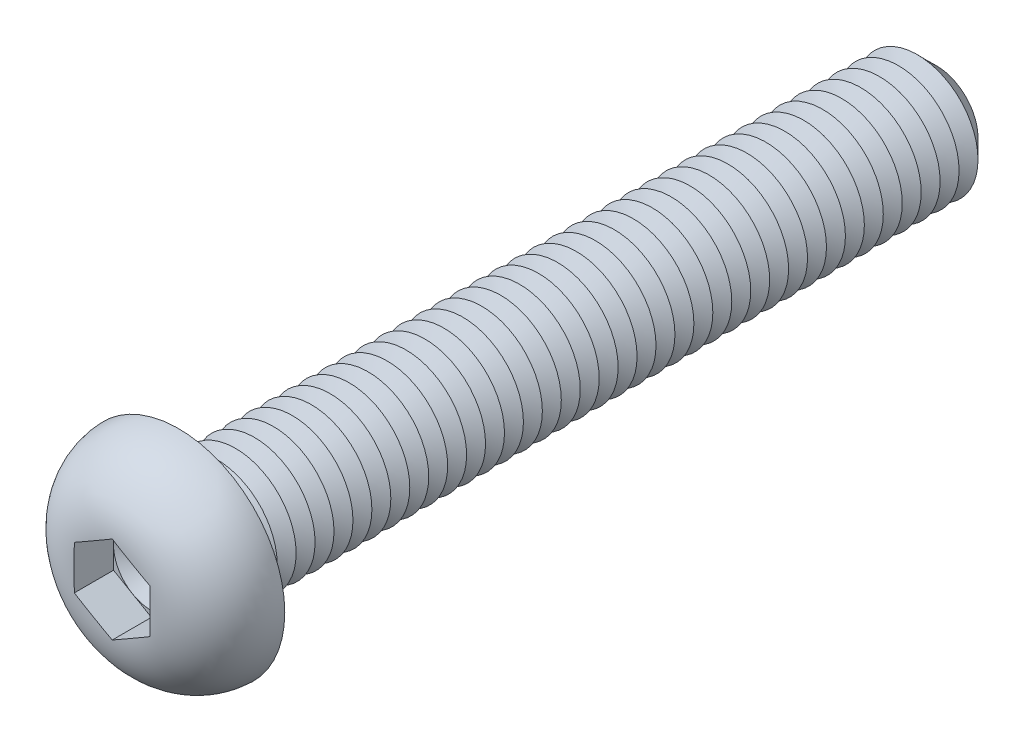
ISO-10303-21;
HEADER;
FILE_DESCRIPTION(('STEP AP214'),'2;1');
FILE_NAME('part.step','',(''),(''),'','','');
FILE_SCHEMA(('AUTOMOTIVE_DESIGN { 1 0 10303 214 1 1 1 1 }'));
ENDSEC;
DATA;
#1=APPLICATION_CONTEXT('core data for automotive mechanical design processes');
#2=APPLICATION_PROTOCOL_DEFINITION('international standard','automotive_design',2000,#1);
#3=PRODUCT_CONTEXT('',#1,'mechanical');
#4=PRODUCT('Part','Part','',(#3));
#5=PRODUCT_RELATED_PRODUCT_CATEGORY('part','',(#4));
#6=PRODUCT_DEFINITION_FORMATION('','',#4);
#7=PRODUCT_DEFINITION_CONTEXT('part definition',#1,'design');
#8=PRODUCT_DEFINITION('design','',#6,#7);
#9=PRODUCT_DEFINITION_SHAPE('','',#8);
#10=(LENGTH_UNIT() NAMED_UNIT(*) SI_UNIT(.MILLI.,.METRE.));
#11=(NAMED_UNIT(*) PLANE_ANGLE_UNIT() SI_UNIT($,.RADIAN.));
#12=(NAMED_UNIT(*) SI_UNIT($,.STERADIAN.) SOLID_ANGLE_UNIT());
#13=UNCERTAINTY_MEASURE_WITH_UNIT(LENGTH_MEASURE(1.E-05),#10,'distance_accuracy_value','');
#14=(GEOMETRIC_REPRESENTATION_CONTEXT(3) GLOBAL_UNCERTAINTY_ASSIGNED_CONTEXT((#13)) GLOBAL_UNIT_ASSIGNED_CONTEXT((#10,
#11,#12)) REPRESENTATION_CONTEXT('',''));
#15=CARTESIAN_POINT('',(0.,0.,0.));
#16=DIRECTION('',(0.,0.,1.));
#17=DIRECTION('',(1.,0.,0.));
#18=AXIS2_PLACEMENT_3D('',#15,#16,#17);
#19=CARTESIAN_POINT('',(0.,0.,1.8));
#20=DIRECTION('',(0.,0.,1.));
#21=DIRECTION('',(1.,0.,0.));
#22=AXIS2_PLACEMENT_3D('',#19,#20,#21);
#23=PLANE('',#22);
#24=CARTESIAN_POINT('',(0.,0.,1.8));
#25=DIRECTION('',(0.,0.,1.));
#26=DIRECTION('',(1.,0.,0.));
#27=AXIS2_PLACEMENT_3D('',#24,#25,#26);
#28=CIRCLE('',#27,2.5);
#29=CARTESIAN_POINT('',(2.5,0.,1.8));
#30=VERTEX_POINT('',#29);
#31=CARTESIAN_POINT('',(1.25,2.1650635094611,1.8));
#32=VERTEX_POINT('',#31);
#33=EDGE_CURVE('E153',#30,#32,#28,.T.);
#34=ORIENTED_EDGE('',*,*,#33,.F.);
#35=DIRECTION('',(0.,1.,0.));
#36=VECTOR('',#35,1.);
#37=CARTESIAN_POINT('',(2.5,-1.44337567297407,1.8));
#38=LINE('',#37,#36);
#39=CARTESIAN_POINT('',(2.5,1.44337567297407,1.8));
#40=VERTEX_POINT('',#39);
#41=EDGE_CURVE('E176',#30,#40,#38,.T.);
#42=ORIENTED_EDGE('',*,*,#41,.T.);
#43=DIRECTION('',(-0.866025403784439,0.5,0.));
#44=VECTOR('',#43,1.);
#45=CARTESIAN_POINT('',(2.5,1.44337567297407,1.8));
#46=LINE('',#45,#44);
#47=EDGE_CURVE('E172',#40,#32,#46,.T.);
#48=ORIENTED_EDGE('',*,*,#47,.T.);
#49=EDGE_LOOP('',(#34,#42,#48));
#50=FACE_BOUND('',#49,.T.);
#51=ADVANCED_FACE('F39',(#50),#23,.T.);
#52=CARTESIAN_POINT('',(0.,0.,1.8));
#53=DIRECTION('',(0.,0.,1.));
#54=DIRECTION('',(1.,0.,0.));
#55=AXIS2_PLACEMENT_3D('',#52,#53,#54);
#56=CIRCLE('',#55,2.5);
#57=CARTESIAN_POINT('',(-1.25,2.1650635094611,1.8));
#58=VERTEX_POINT('',#57);
#59=EDGE_CURVE('E11',#32,#58,#56,.T.);
#60=ORIENTED_EDGE('',*,*,#59,.F.);
#61=CARTESIAN_POINT('',(0.,2.88675134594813,1.8));
#62=VERTEX_POINT('',#61);
#63=EDGE_CURVE('E166',#32,#62,#46,.T.);
#64=ORIENTED_EDGE('',*,*,#63,.T.);
#65=DIRECTION('',(-0.866025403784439,-0.5,0.));
#66=VECTOR('',#65,1.);
#67=CARTESIAN_POINT('',(0.,2.88675134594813,1.8));
#68=LINE('',#67,#66);
#69=EDGE_CURVE('E167',#62,#58,#68,.T.);
#70=ORIENTED_EDGE('',*,*,#69,.T.);
#71=EDGE_LOOP('',(#60,#64,#70));
#72=FACE_BOUND('',#71,.T.);
#73=ADVANCED_FACE('F165',(#72),#23,.T.);
#74=CARTESIAN_POINT('',(-2.5,0.,1.8));
#75=VERTEX_POINT('',#74);
#76=EDGE_CURVE('E49',#58,#75,#56,.T.);
#77=ORIENTED_EDGE('',*,*,#76,.F.);
#78=CARTESIAN_POINT('',(-2.5,1.44337567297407,1.8));
#79=VERTEX_POINT('',#78);
#80=EDGE_CURVE('E179',#58,#79,#68,.T.);
#81=ORIENTED_EDGE('',*,*,#80,.T.);
#82=DIRECTION('',(0.,-1.,0.));
#83=VECTOR('',#82,1.);
#84=CARTESIAN_POINT('',(-2.5,1.44337567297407,1.8));
#85=LINE('',#84,#83);
#86=EDGE_CURVE('E190',#79,#75,#85,.T.);
#87=ORIENTED_EDGE('',*,*,#86,.T.);
#88=EDGE_LOOP('',(#77,#81,#87));
#89=FACE_BOUND('',#88,.T.);
#90=ADVANCED_FACE('F440',(#89),#23,.T.);
#91=CARTESIAN_POINT('',(-1.25,-2.1650635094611,1.8));
#92=VERTEX_POINT('',#91);
#93=EDGE_CURVE('E422',#75,#92,#56,.T.);
#94=ORIENTED_EDGE('',*,*,#93,.F.);
#95=CARTESIAN_POINT('',(-2.5,-1.44337567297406,1.8));
#96=VERTEX_POINT('',#95);
#97=EDGE_CURVE('E189',#75,#96,#85,.T.);
#98=ORIENTED_EDGE('',*,*,#97,.T.);
#99=DIRECTION('',(0.866025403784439,-0.5,0.));
#100=VECTOR('',#99,1.);
#101=CARTESIAN_POINT('',(-2.5,-1.44337567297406,1.8));
#102=LINE('',#101,#100);
#103=EDGE_CURVE('E195',#96,#92,#102,.T.);
#104=ORIENTED_EDGE('',*,*,#103,.T.);
#105=EDGE_LOOP('',(#94,#98,#104));
#106=FACE_BOUND('',#105,.T.);
#107=ADVANCED_FACE('F435',(#106),#23,.T.);
#108=CARTESIAN_POINT('',(1.25,-2.1650635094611,1.8));
#109=VERTEX_POINT('',#108);
#110=EDGE_CURVE('E56',#92,#109,#56,.T.);
#111=ORIENTED_EDGE('',*,*,#110,.F.);
#112=CARTESIAN_POINT('',(0.,-2.88675134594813,1.8));
#113=VERTEX_POINT('',#112);
#114=EDGE_CURVE('E194',#92,#113,#102,.T.);
#115=ORIENTED_EDGE('',*,*,#114,.T.);
#116=DIRECTION('',(0.866025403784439,0.5,0.));
#117=VECTOR('',#116,1.);
#118=CARTESIAN_POINT('',(0.,-2.88675134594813,1.8));
#119=LINE('',#118,#117);
#120=EDGE_CURVE('E200',#113,#109,#119,.T.);
#121=ORIENTED_EDGE('',*,*,#120,.T.);
#122=EDGE_LOOP('',(#111,#115,#121));
#123=FACE_BOUND('',#122,.T.);
#124=ADVANCED_FACE('F475',(#123),#23,.T.);
#125=CARTESIAN_POINT('',(0.,0.,-50.));
#126=DIRECTION('',(0.,0.,1.));
#127=DIRECTION('',(1.,0.,0.));
#128=AXIS2_PLACEMENT_3D('',#125,#126,#127);
#129=CYLINDRICAL_SURFACE('',#128,4.);
#130=CARTESIAN_POINT('',(0.,0.,-0.5));
#131=DIRECTION('',(0.,0.,1.));
#132=DIRECTION('',(1.,0.,0.));
#133=AXIS2_PLACEMENT_3D('',#130,#131,#132);
#134=CIRCLE('',#133,4.);
#135=CARTESIAN_POINT('',(4.,0.,-0.5));
#136=VERTEX_POINT('',#135);
#137=EDGE_CURVE('E410',#136,#136,#134,.F.);
#138=ORIENTED_EDGE('',*,*,#137,.T.);
#139=EDGE_LOOP('',(#138));
#140=FACE_BOUND('',#139,.T.);
#141=CARTESIAN_POINT('',(0.,0.,-1.25));
#142=DIRECTION('',(0.,0.,1.));
#143=DIRECTION('',(1.,0.,0.));
#144=AXIS2_PLACEMENT_3D('',#141,#142,#143);
#145=CIRCLE('',#144,4.00000000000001);
#146=CARTESIAN_POINT('',(4.00000000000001,0.,-1.25));
#147=VERTEX_POINT('',#146);
#148=EDGE_CURVE('E185',#147,#147,#145,.T.);
#149=ORIENTED_EDGE('',*,*,#148,.T.);
#150=EDGE_LOOP('',(#149));
#151=FACE_BOUND('',#150,.T.);
#152=ADVANCED_FACE('F470',(#140,#151),#129,.T.);
#153=CARTESIAN_POINT('',(0.,7.,0.));
#154=DIRECTION('',(0.,0.,1.));
#155=DIRECTION('',(1.,0.,0.));
#156=AXIS2_PLACEMENT_3D('',#153,#154,#155);
#157=PLANE('',#156);
#158=CARTESIAN_POINT('',(0.,0.,0.));
#159=DIRECTION('',(0.,0.,1.));
#160=DIRECTION('',(1.,0.,0.));
#161=AXIS2_PLACEMENT_3D('',#158,#159,#160);
#162=CIRCLE('',#161,4.5);
#163=CARTESIAN_POINT('',(4.5,0.,0.));
#164=VERTEX_POINT('',#163);
#165=EDGE_CURVE('E413',#164,#164,#162,.T.);
#166=ORIENTED_EDGE('',*,*,#165,.T.);
#167=EDGE_LOOP('',(#166));
#168=FACE_BOUND('',#167,.T.);
#169=CARTESIAN_POINT('',(0.,0.,0.));
#170=DIRECTION('',(0.,0.,1.));
#171=DIRECTION('',(1.,0.,0.));
#172=AXIS2_PLACEMENT_3D('',#169,#170,#171);
#173=CIRCLE('',#172,7.);
#174=CARTESIAN_POINT('',(7.,0.,0.));
#175=VERTEX_POINT('',#174);
#176=EDGE_CURVE('E211',#175,#175,#173,.T.);
#177=ORIENTED_EDGE('',*,*,#176,.F.);
#178=EDGE_LOOP('',(#177));
#179=FACE_BOUND('',#178,.T.);
#180=ADVANCED_FACE('F468',(#168,#179),#157,.F.);
#181=CARTESIAN_POINT('',(0.,0.,-0.1));
#182=DIRECTION('',(0.,0.,1.));
#183=DIRECTION('',(1.,0.,0.));
#184=AXIS2_PLACEMENT_3D('',#181,#182,#183);
#185=DEGENERATE_TOROIDAL_SURFACE('',#184,2.5011112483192,4.5,.T.);
#186=CARTESIAN_POINT('',(1.31456088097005,2.12778926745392,4.4));
#187=DIRECTION('',(-0.866025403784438,0.500000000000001,0.));
#188=VECTOR('',#187,1.);
#189=LINE('',#186,#188);
#190=CARTESIAN_POINT('',(1.31456088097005,2.12778926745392,4.4));
#191=VERTEX_POINT('',#190);
#192=CARTESIAN_POINT('',(1.18543911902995,2.20233775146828,4.4));
#193=VERTEX_POINT('',#192);
#194=EDGE_CURVE('E399',#191,#193,#189,.T.);
#195=ORIENTED_EDGE('',*,*,#194,.F.);
#196=CARTESIAN_POINT('',(-0.000200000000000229,2.88686681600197,4.38343536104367));
#197=CARTESIAN_POINT('',(0.103935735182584,2.82674402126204,4.38859262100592));
#198=CARTESIAN_POINT('',(0.208111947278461,2.76659785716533,4.39207570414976));
#199=CARTESIAN_POINT('',(0.416486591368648,2.64629270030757,4.39683754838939));
#200=CARTESIAN_POINT('',(0.520685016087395,2.58613371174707,4.39811670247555));
#201=CARTESIAN_POINT('',(0.729066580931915,2.46582455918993,4.3996156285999));
#202=CARTESIAN_POINT('',(0.833249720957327,2.40567439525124,4.39983556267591));
#203=CARTESIAN_POINT('',(1.04162190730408,2.2853706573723,4.4000276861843));
#204=CARTESIAN_POINT('',(1.14581095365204,2.2252170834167,4.39999986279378));
#205=CARTESIAN_POINT('',(1.35418904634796,2.10490993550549,4.39999986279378));
#206=CARTESIAN_POINT('',(1.45837809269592,2.04475636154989,4.4000276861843));
#207=CARTESIAN_POINT('',(1.66675027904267,1.92445262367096,4.39983556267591));
#208=CARTESIAN_POINT('',(1.77093341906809,1.86430245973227,4.3996156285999));
#209=CARTESIAN_POINT('',(1.97931498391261,1.74399330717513,4.39811670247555));
#210=CARTESIAN_POINT('',(2.08351340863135,1.68383431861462,4.39683754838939));
#211=CARTESIAN_POINT('',(2.29188805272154,1.56352916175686,4.39207570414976));
#212=CARTESIAN_POINT('',(2.39606426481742,1.50338299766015,4.38859262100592));
#213=CARTESIAN_POINT('',(2.5002,1.44326020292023,4.38343536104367));
#214=B_SPLINE_CURVE_WITH_KNOTS('',3,(#196,#197,#198,#199,#200,#201,#202,#203,#204,#205,#206,
#207,#208,#209,#210,#211,#212,#213),.UNSPECIFIED.,.F.,.F.,(4,2,2,2,2,2,2,2,4),(0.,
0.361022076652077,0.721979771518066,1.08288224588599,1.44380339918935,1.80472455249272,
2.16562702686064,2.52658472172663,2.88760679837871),.UNSPECIFIED.);
#215=CARTESIAN_POINT('',(2.5,1.44337567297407,4.38344529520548));
#216=VERTEX_POINT('',#215);
#217=EDGE_CURVE('E355',#191,#216,#214,.T.);
#218=ORIENTED_EDGE('',*,*,#217,.T.);
#219=CARTESIAN_POINT('',(2.5,0.,4.39999986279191));
#220=CARTESIAN_POINT('',(2.5,-0.104697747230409,4.39999811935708));
#221=CARTESIAN_POINT('',(2.5,-0.209395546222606,4.40001551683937));
#222=CARTESIAN_POINT('',(2.5,-0.418792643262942,4.39990807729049));
#223=CARTESIAN_POINT('',(2.5,-0.52349194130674,4.39978323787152));
#224=CARTESIAN_POINT('',(2.5,-0.732936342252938,4.39891238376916));
#225=CARTESIAN_POINT('',(2.5,-0.837681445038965,4.39816609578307));
#226=CARTESIAN_POINT('',(2.5,-1.04715282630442,4.39536239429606));
#227=CARTESIAN_POINT('',(2.5,-1.15187910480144,4.39330498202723));
#228=CARTESIAN_POINT('',(2.5,-1.46476484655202,4.38400647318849));
#229=CARTESIAN_POINT('',(2.5,-1.67286375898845,4.37365196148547));
#230=CARTESIAN_POINT('',(2.5,-2.08783281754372,4.33852954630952));
#231=CARTESIAN_POINT('',(2.5,-2.29470379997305,4.31377296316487));
#232=CARTESIAN_POINT('',(2.5,-2.64451002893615,4.25536510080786));
#233=CARTESIAN_POINT('',(2.5,-2.78823975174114,4.22651785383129));
#234=CARTESIAN_POINT('',(2.5,-3.073224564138,4.15827060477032));
#235=CARTESIAN_POINT('',(2.5,-3.21447933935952,4.11886927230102));
#236=CARTESIAN_POINT('',(2.5,-3.49353952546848,4.02870287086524));
#237=CARTESIAN_POINT('',(2.5,-3.6313402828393,3.97792330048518));
#238=CARTESIAN_POINT('',(2.5,-3.90204977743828,3.86463774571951));
#239=CARTESIAN_POINT('',(2.5,-4.0349587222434,3.8021322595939));
#240=CARTESIAN_POINT('',(2.5,-4.2956525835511,3.66474880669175));
#241=CARTESIAN_POINT('',(2.5,-4.42338586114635,3.58977252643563));
#242=CARTESIAN_POINT('',(2.5,-4.67118559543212,3.42803136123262));
#243=CARTESIAN_POINT('',(2.5,-4.79125159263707,3.3412657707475));
#244=CARTESIAN_POINT('',(2.5,-5.02233156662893,3.15645800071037));
#245=CARTESIAN_POINT('',(2.5,-5.13334771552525,3.05841854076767));
#246=CARTESIAN_POINT('',(2.5,-5.34506083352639,2.85177471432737));
#247=CARTESIAN_POINT('',(2.5,-5.44575933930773,2.74317192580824));
#248=CARTESIAN_POINT('',(2.5,-5.62335564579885,2.53102225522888));
#249=CARTESIAN_POINT('',(2.5,-5.70164721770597,2.42863868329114));
#250=CARTESIAN_POINT('',(2.5,-5.84882394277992,2.21725758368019));
#251=CARTESIAN_POINT('',(2.5,-5.91770588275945,2.10825781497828));
#252=CARTESIAN_POINT('',(2.5,-6.04532926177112,1.88460009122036));
#253=CARTESIAN_POINT('',(2.5,-6.1040794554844,1.76994713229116));
#254=CARTESIAN_POINT('',(2.5,-6.21098181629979,1.53574793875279));
#255=CARTESIAN_POINT('',(2.5,-6.25913021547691,1.41619998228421));
#256=CARTESIAN_POINT('',(2.5,-6.34173830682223,1.18065209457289));
#257=CARTESIAN_POINT('',(2.5,-6.37685491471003,1.06488207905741));
#258=CARTESIAN_POINT('',(2.5,-6.43703913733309,0.830714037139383));
#259=CARTESIAN_POINT('',(2.5,-6.46210319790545,0.712315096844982));
#260=CARTESIAN_POINT('',(2.5,-6.50194044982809,0.473848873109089));
#261=CARTESIAN_POINT('',(2.5,-6.51671856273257,0.353782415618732));
#262=CARTESIAN_POINT('',(2.5,-6.53588982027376,0.112808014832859));
#263=CARTESIAN_POINT('',(2.5,-6.54027911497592,-0.00810022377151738));
#264=CARTESIAN_POINT('',(2.5,-6.53779027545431,-0.365870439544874));
#265=CARTESIAN_POINT('',(2.5,-6.51607942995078,-0.602790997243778));
#266=CARTESIAN_POINT('',(2.5,-6.43310265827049,-1.06957107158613));
#267=CARTESIAN_POINT('',(2.5,-6.3718398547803,-1.29943114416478));
#268=CARTESIAN_POINT('',(2.5,-6.25195024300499,-1.63390601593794));
#269=CARTESIAN_POINT('',(2.5,-6.20730237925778,-1.74371189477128));
#270=CARTESIAN_POINT('',(2.5,-6.10902350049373,-1.95921136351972));
#271=CARTESIAN_POINT('',(2.5,-6.05539567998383,-2.06490639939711));
#272=CARTESIAN_POINT('',(2.5,-5.93955620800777,-2.27152527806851));
#273=CARTESIAN_POINT('',(2.5,-5.87734126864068,-2.37244727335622));
#274=CARTESIAN_POINT('',(2.5,-5.7448545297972,-2.56880727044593));
#275=CARTESIAN_POINT('',(2.5,-5.67458537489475,-2.6642470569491));
#276=CARTESIAN_POINT('',(2.5,-5.52523018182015,-2.85070592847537));
#277=CARTESIAN_POINT('',(2.5,-5.44601185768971,-2.94161901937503));
#278=CARTESIAN_POINT('',(2.5,-5.28044044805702,-3.11663859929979));
#279=CARTESIAN_POINT('',(2.5,-5.194089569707,-3.2007471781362));
#280=CARTESIAN_POINT('',(2.5,-5.01485870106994,-3.36178408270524));
#281=CARTESIAN_POINT('',(2.5,-4.92197538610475,-3.43870870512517));
#282=CARTESIAN_POINT('',(2.5,-4.73045535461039,-3.58495812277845));
#283=CARTESIAN_POINT('',(2.5,-4.6318202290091,-3.65428500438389));
#284=CARTESIAN_POINT('',(2.5,-4.4247626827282,-3.78818551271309));
#285=CARTESIAN_POINT('',(2.5,-4.31609824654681,-3.85238474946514));
#286=CARTESIAN_POINT('',(2.5,-4.0940582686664,-3.97208975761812));
#287=CARTESIAN_POINT('',(2.5,-3.98068153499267,-4.02759331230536));
#288=CARTESIAN_POINT('',(2.5,-3.75029026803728,-4.12981004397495));
#289=CARTESIAN_POINT('',(2.5,-3.63328275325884,-4.17653908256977));
#290=CARTESIAN_POINT('',(2.5,-3.39631992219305,-4.2614893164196));
#291=CARTESIAN_POINT('',(2.5,-3.27636651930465,-4.29971587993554));
#292=CARTESIAN_POINT('',(2.5,-3.00446622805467,-4.37644925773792));
#293=CARTESIAN_POINT('',(2.5,-2.85188931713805,-4.41272455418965));
#294=CARTESIAN_POINT('',(2.5,-2.54443794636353,-4.47385449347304));
#295=CARTESIAN_POINT('',(2.5,-2.3895624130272,-4.49870361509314));
#296=CARTESIAN_POINT('',(2.5,-2.07807451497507,-4.53870829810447));
#297=CARTESIAN_POINT('',(2.5,-1.92145805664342,-4.55383091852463));
#298=CARTESIAN_POINT('',(2.5,-1.60772330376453,-4.57647936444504));
#299=CARTESIAN_POINT('',(2.5,-1.45060502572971,-4.58400543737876));
#300=CARTESIAN_POINT('',(2.5,-1.13432460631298,-4.59416656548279));
#301=CARTESIAN_POINT('',(2.5,-0.975160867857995,-4.59674096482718));
#302=CARTESIAN_POINT('',(2.5,-0.656826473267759,-4.59957813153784));
#303=CARTESIAN_POINT('',(2.5,-0.497655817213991,-4.59984092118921));
#304=CARTESIAN_POINT('',(2.5,-0.179547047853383,-4.60005428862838));
#305=CARTESIAN_POINT('',(2.5,-0.02060893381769,-4.60000532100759));
#306=CARTESIAN_POINT('',(2.5,0.297265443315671,-4.59999304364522));
#307=CARTESIAN_POINT('',(2.5,0.456201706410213,-4.60002973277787));
#308=CARTESIAN_POINT('',(2.5,0.70967559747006,-4.59902611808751));
#309=CARTESIAN_POINT('',(2.5,0.804213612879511,-4.59841616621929));
#310=CARTESIAN_POINT('',(2.5,0.99327694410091,-4.59620676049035));
#311=CARTESIAN_POINT('',(2.5,1.08780225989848,-4.59460730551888));
#312=CARTESIAN_POINT('',(2.5,1.37137837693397,-4.58746770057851));
#313=CARTESIAN_POINT('',(2.5,1.56039301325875,-4.57958602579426));
#314=CARTESIAN_POINT('',(2.5,1.93609462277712,-4.55305686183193));
#315=CARTESIAN_POINT('',(2.5,2.12278756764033,-4.53450331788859));
#316=CARTESIAN_POINT('',(2.5,2.49421016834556,-4.48296248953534));
#317=CARTESIAN_POINT('',(2.5,2.67894050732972,-4.44998040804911));
#318=CARTESIAN_POINT('',(2.5,2.99962701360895,-4.37718406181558));
#319=CARTESIAN_POINT('',(2.5,3.13641465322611,-4.34103978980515));
#320=CARTESIAN_POINT('',(2.5,3.40682838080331,-4.25834226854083));
#321=CARTESIAN_POINT('',(2.5,3.54045461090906,-4.21178948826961));
#322=CARTESIAN_POINT('',(2.5,3.80387940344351,-4.1076796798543));
#323=CARTESIAN_POINT('',(2.5,3.93366385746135,-4.05008679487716));
#324=CARTESIAN_POINT('',(2.5,4.18776789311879,-3.92385886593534));
#325=CARTESIAN_POINT('',(2.5,4.31208736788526,-3.85522360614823));
#326=CARTESIAN_POINT('',(2.5,4.55475418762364,-3.70660227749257));
#327=CARTESIAN_POINT('',(2.5,4.67306276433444,-3.62655275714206));
#328=CARTESIAN_POINT('',(2.5,4.90171316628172,-3.45576294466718));
#329=CARTESIAN_POINT('',(2.5,5.01205476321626,-3.36502234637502));
#330=CARTESIAN_POINT('',(2.5,5.22347091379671,-3.17353376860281));
#331=CARTESIAN_POINT('',(2.5,5.32455555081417,-3.07279693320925));
#332=CARTESIAN_POINT('',(2.5,5.51647993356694,-2.86200023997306));
#333=CARTESIAN_POINT('',(2.5,5.6073208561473,-2.75194145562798));
#334=CARTESIAN_POINT('',(2.5,5.76832451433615,-2.53607083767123));
#335=CARTESIAN_POINT('',(2.5,5.83966300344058,-2.4311337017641));
#336=CARTESIAN_POINT('',(2.5,5.97282702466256,-2.2153291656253));
#337=CARTESIAN_POINT('',(2.5,6.03464926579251,-2.10445973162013));
#338=CARTESIAN_POINT('',(2.5,6.14815657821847,-1.87771731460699));
#339=CARTESIAN_POINT('',(2.5,6.19984675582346,-1.76184688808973));
#340=CARTESIAN_POINT('',(2.5,6.29267395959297,-1.52590109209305));
#341=CARTESIAN_POINT('',(2.5,6.33380720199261,-1.40582423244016));
#342=CARTESIAN_POINT('',(2.5,6.40328888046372,-1.16869740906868));
#343=CARTESIAN_POINT('',(2.5,6.43218419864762,-1.05180738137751));
#344=CARTESIAN_POINT('',(2.5,6.47988151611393,-0.815941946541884));
#345=CARTESIAN_POINT('',(2.5,6.49867991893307,-0.696965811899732));
#346=CARTESIAN_POINT('',(2.5,6.52599950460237,-0.457898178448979));
#347=CARTESIAN_POINT('',(2.5,6.53452634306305,-0.337807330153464));
#348=CARTESIAN_POINT('',(2.5,6.54126106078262,-0.0973214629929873));
#349=CARTESIAN_POINT('',(2.5,6.5394651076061,0.023073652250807));
#350=CARTESIAN_POINT('',(2.5,6.51879545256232,0.379398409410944));
#351=CARTESIAN_POINT('',(2.5,6.48510560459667,0.614630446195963));
#352=CARTESIAN_POINT('',(2.5,6.37872360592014,1.07608887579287));
#353=CARTESIAN_POINT('',(2.5,6.30603128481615,1.3023152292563));
#354=CARTESIAN_POINT('',(2.5,6.16957161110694,1.63028303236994));
#355=CARTESIAN_POINT('',(2.5,6.11941470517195,1.7378698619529));
#356=CARTESIAN_POINT('',(2.5,6.01034124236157,1.94849153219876));
#357=CARTESIAN_POINT('',(2.5,5.9514277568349,2.05152795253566));
#358=CARTESIAN_POINT('',(2.5,5.82528890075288,2.25240256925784));
#359=CARTESIAN_POINT('',(2.5,5.75806159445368,2.35023954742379));
#360=CARTESIAN_POINT('',(2.5,5.61585543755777,2.54005689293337));
#361=CARTESIAN_POINT('',(2.5,5.54087908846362,2.63203913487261));
#362=CARTESIAN_POINT('',(2.5,5.38212190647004,2.81146438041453));
#363=CARTESIAN_POINT('',(2.5,5.29819182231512,2.89877528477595));
#364=CARTESIAN_POINT('',(2.5,5.12353712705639,3.06625194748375));
#365=CARTESIAN_POINT('',(2.5,5.03281455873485,3.14641983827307));
#366=CARTESIAN_POINT('',(2.5,4.84518171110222,3.29930665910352));
#367=CARTESIAN_POINT('',(2.5,4.74826657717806,3.37201962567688));
#368=CARTESIAN_POINT('',(2.5,4.54907485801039,3.50961479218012));
#369=CARTESIAN_POINT('',(2.5,4.44679969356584,3.57449905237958));
#370=CARTESIAN_POINT('',(2.5,4.23202545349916,3.69953578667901));
#371=CARTESIAN_POINT('',(2.5,4.11927203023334,3.75925114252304));
#372=CARTESIAN_POINT('',(2.5,3.88947986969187,3.86977617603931));
#373=CARTESIAN_POINT('',(2.5,3.77244067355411,3.92058489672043));
#374=CARTESIAN_POINT('',(2.5,3.5351804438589,4.0133148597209));
#375=CARTESIAN_POINT('',(2.5,3.41496637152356,4.0552539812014));
#376=CARTESIAN_POINT('',(2.5,3.17195278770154,4.13067246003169));
#377=CARTESIAN_POINT('',(2.5,3.04915378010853,4.16415344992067));
#378=CARTESIAN_POINT('',(2.5,2.80683027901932,4.22194717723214));
#379=CARTESIAN_POINT('',(2.5,2.68738216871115,4.2465834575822));
#380=CARTESIAN_POINT('',(2.5,2.44729214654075,4.28920746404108));
#381=CARTESIAN_POINT('',(2.5,2.32664997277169,4.30719369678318));
#382=CARTESIAN_POINT('',(2.5,2.08450864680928,4.33736171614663));
#383=CARTESIAN_POINT('',(2.5,1.9630086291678,4.3495363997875));
#384=CARTESIAN_POINT('',(2.5,1.71961501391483,4.36908103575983));
#385=CARTESIAN_POINT('',(2.5,1.59772134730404,4.37645009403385));
#386=CARTESIAN_POINT('',(2.5,1.35283283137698,4.38761579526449));
#387=CARTESIAN_POINT('',(2.5,1.22983679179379,4.39138420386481));
#388=CARTESIAN_POINT('',(2.5,0.983808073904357,4.3965493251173));
#389=CARTESIAN_POINT('',(2.5,0.860775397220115,4.3979461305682));
#390=CARTESIAN_POINT('',(2.5,0.614783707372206,4.39958107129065));
#391=CARTESIAN_POINT('',(2.5,0.491824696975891,4.3998199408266));
#392=CARTESIAN_POINT('',(2.5,0.245910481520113,4.40003035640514));
#393=CARTESIAN_POINT('',(2.5,0.122955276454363,4.4000019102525));
#394=CARTESIAN_POINT('',(2.5,0.,4.39999986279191));
#395=B_SPLINE_CURVE_WITH_KNOTS('',3,(#219,#220,#221,#222,#223,#224,#225,#226,#227,#228,#229,
#230,#231,#232,#233,#234,#235,#236,#237,#238,#239,#240,#241,#242,#243,#244,#245,#246,#247,#248,
#249,#250,#251,#252,#253,#254,#255,#256,#257,#258,#259,#260,#261,#262,#263,#264,#265,#266,#267,
#268,#269,#270,#271,#272,#273,#274,#275,#276,#277,#278,#279,#280,#281,#282,#283,#284,#285,#286,
#287,#288,#289,#290,#291,#292,#293,#294,#295,#296,#297,#298,#299,#300,#301,#302,#303,#304,#305,
#306,#307,#308,#309,#310,#311,#312,#313,#314,#315,#316,#317,#318,#319,#320,#321,#322,#323,#324,
#325,#326,#327,#328,#329,#330,#331,#332,#333,#334,#335,#336,#337,#338,#339,#340,#341,#342,#343,
#344,#345,#346,#347,#348,#349,#350,#351,#352,#353,#354,#355,#356,#357,#358,#359,#360,#361,#362,
#363,#364,#365,#366,#367,#368,#369,#370,#371,#372,#373,#374,#375,#376,#377,#378,#379,#380,#381,
#382,#383,#384,#385,#386,#387,#388,#389,#390,#391,#392,#393,#394),.UNSPECIFIED.,.T.,.F.,(4,2,2,
2,2,2,2,2,2,2,2,2,2,2,2,2,2,2,2,2,2,2,2,2,2,2,2,2,2,2,2,2,2,2,2,2,2,2,2,2,2,2,2,2,2,2,2,2,2,2,2,
2,2,2,2,2,2,2,2,2,2,2,2,2,2,2,2,2,2,2,2,2,2,2,2,2,2,2,2,2,2,2,2,2,2,2,2,4),(0.,
0.314093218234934,0.62819170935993,0.942428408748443,1.25666481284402,1.88144147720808,
2.50572771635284,2.94516878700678,3.38466527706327,3.82472511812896,4.26476626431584,
4.70845695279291,5.15217420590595,5.59578464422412,6.03932891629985,6.42549664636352,
6.81179591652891,7.19775970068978,7.58386043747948,7.94635637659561,8.30898036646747,
8.67143073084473,9.03401539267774,9.74414367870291,10.4542159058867,10.8094792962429,
11.1646165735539,11.5198902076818,11.8750475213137,12.2363927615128,12.597626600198,
12.9590456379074,13.3203651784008,13.698597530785,14.0769261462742,14.4545641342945,
14.8319630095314,15.3019396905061,15.7721432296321,16.2439309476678,16.715703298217,
17.1932187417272,17.6707295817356,18.1475442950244,18.6243527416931,18.9079682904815,
19.1915841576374,19.7589248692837,20.3213460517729,20.8835645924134,21.3076400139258,
21.731696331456,22.1571540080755,22.5826200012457,23.0105507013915,23.4384936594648,
23.8659647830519,24.2933867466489,24.6735755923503,25.0538956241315,25.4340234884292,
25.8142874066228,26.1750761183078,26.5359932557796,26.8967115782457,27.2575638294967,
27.9668653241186,28.6761699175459,29.0319382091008,29.3875820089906,29.7433087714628,
30.0989210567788,30.4618400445,30.8246503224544,31.1877485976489,31.5507511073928,
31.9331198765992,32.3155297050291,32.6971611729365,33.0787189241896,33.4443988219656,
33.8101607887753,34.1763686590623,34.54264464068,34.9117697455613,35.2808804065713,
35.6497569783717,36.0186227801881),.UNSPECIFIED.);
#396=CARTESIAN_POINT('',(2.5,0.0745484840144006,4.4));
#397=VERTEX_POINT('',#396);
#398=EDGE_CURVE('E345',#216,#397,#395,.T.);
#399=ORIENTED_EDGE('',*,*,#398,.T.);
#400=CARTESIAN_POINT('',(2.5,-0.0745484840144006,4.4));
#401=DIRECTION('',(0.,1.,0.));
#402=VECTOR('',#401,1.);
#403=LINE('',#400,#402);
#404=CARTESIAN_POINT('',(2.5,-0.0745484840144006,4.4));
#405=VERTEX_POINT('',#404);
#406=EDGE_CURVE('E174',#405,#397,#403,.T.);
#407=ORIENTED_EDGE('',*,*,#406,.F.);
#408=CARTESIAN_POINT('',(2.5,-1.44337567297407,4.38344529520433));
#409=VERTEX_POINT('',#408);
#410=EDGE_CURVE('E356',#405,#409,#395,.T.);
#411=ORIENTED_EDGE('',*,*,#410,.T.);
#412=CARTESIAN_POINT('',(2.5002,-1.44326020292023,4.38343536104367));
#413=CARTESIAN_POINT('',(2.39606426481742,-1.50338299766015,4.38859262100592));
#414=CARTESIAN_POINT('',(2.29188805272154,-1.56352916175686,4.39207570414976));
#415=CARTESIAN_POINT('',(2.08351340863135,-1.68383431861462,4.39683754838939));
#416=CARTESIAN_POINT('',(1.9793149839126,-1.74399330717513,4.39811670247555));
#417=CARTESIAN_POINT('',(1.77093341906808,-1.86430245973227,4.3996156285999));
#418=CARTESIAN_POINT('',(1.66675027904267,-1.92445262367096,4.39983556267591));
#419=CARTESIAN_POINT('',(1.45837809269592,-2.04475636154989,4.4000276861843));
#420=CARTESIAN_POINT('',(1.35418904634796,-2.10490993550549,4.39999986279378));
#421=CARTESIAN_POINT('',(1.14581095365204,-2.2252170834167,4.39999986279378));
#422=CARTESIAN_POINT('',(1.04162190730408,-2.2853706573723,4.4000276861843));
#423=CARTESIAN_POINT('',(0.833249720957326,-2.40567439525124,4.39983556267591));
#424=CARTESIAN_POINT('',(0.729066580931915,-2.46582455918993,4.3996156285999));
#425=CARTESIAN_POINT('',(0.520685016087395,-2.58613371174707,4.39811670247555));
#426=CARTESIAN_POINT('',(0.416486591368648,-2.64629270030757,4.39683754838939));
#427=CARTESIAN_POINT('',(0.208111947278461,-2.76659785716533,4.39207570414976));
#428=CARTESIAN_POINT('',(0.103935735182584,-2.82674402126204,4.38859262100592));
#429=CARTESIAN_POINT('',(-0.000200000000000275,-2.88686681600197,4.38343536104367));
#430=B_SPLINE_CURVE_WITH_KNOTS('',3,(#412,#413,#414,#415,#416,#417,#418,#419,#420,#421,#422,
#423,#424,#425,#426,#427,#428,#429),.UNSPECIFIED.,.F.,.F.,(4,2,2,2,2,2,2,2,4),(0.,
0.361022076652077,0.721979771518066,1.08288224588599,1.44380339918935,1.80472455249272,
2.16562702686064,2.52658472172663,2.88760679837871),.UNSPECIFIED.);
#431=CARTESIAN_POINT('',(1.31456088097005,-2.12778926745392,4.4));
#432=VERTEX_POINT('',#431);
#433=EDGE_CURVE('E332',#409,#432,#430,.T.);
#434=ORIENTED_EDGE('',*,*,#433,.T.);
#435=CARTESIAN_POINT('',(1.18543911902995,-2.20233775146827,4.4));
#436=DIRECTION('',(0.866025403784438,0.500000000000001,0.));
#437=VECTOR('',#436,1.);
#438=LINE('',#435,#437);
#439=CARTESIAN_POINT('',(1.18543911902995,-2.20233775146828,4.4));
#440=VERTEX_POINT('',#439);
#441=EDGE_CURVE('E341',#440,#432,#438,.T.);
#442=ORIENTED_EDGE('',*,*,#441,.F.);
#443=CARTESIAN_POINT('',(0.,-2.88675134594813,4.38344529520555));
#444=VERTEX_POINT('',#443);
#445=EDGE_CURVE('E295',#440,#444,#430,.T.);
#446=ORIENTED_EDGE('',*,*,#445,.T.);
#447=CARTESIAN_POINT('',(0.00019999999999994,-2.88686681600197,4.38343536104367));
#448=CARTESIAN_POINT('',(-0.103935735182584,-2.82674402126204,4.38859262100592));
#449=CARTESIAN_POINT('',(-0.208111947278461,-2.76659785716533,4.39207570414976));
#450=CARTESIAN_POINT('',(-0.416486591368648,-2.64629270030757,4.39683754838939));
#451=CARTESIAN_POINT('',(-0.520685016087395,-2.58613371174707,4.39811670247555));
#452=CARTESIAN_POINT('',(-0.729066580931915,-2.46582455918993,4.3996156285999));
#453=CARTESIAN_POINT('',(-0.833249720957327,-2.40567439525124,4.39983556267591));
#454=CARTESIAN_POINT('',(-1.04162190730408,-2.2853706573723,4.4000276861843));
#455=CARTESIAN_POINT('',(-1.14581095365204,-2.2252170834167,4.39999986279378));
#456=CARTESIAN_POINT('',(-1.35418904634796,-2.10490993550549,4.39999986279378));
#457=CARTESIAN_POINT('',(-1.45837809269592,-2.04475636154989,4.4000276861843));
#458=CARTESIAN_POINT('',(-1.66675027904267,-1.92445262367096,4.39983556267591));
#459=CARTESIAN_POINT('',(-1.77093341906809,-1.86430245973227,4.3996156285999));
#460=CARTESIAN_POINT('',(-1.97931498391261,-1.74399330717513,4.39811670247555));
#461=CARTESIAN_POINT('',(-2.08351340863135,-1.68383431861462,4.39683754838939));
#462=CARTESIAN_POINT('',(-2.29188805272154,-1.56352916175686,4.39207570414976));
#463=CARTESIAN_POINT('',(-2.39606426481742,-1.50338299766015,4.38859262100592));
#464=CARTESIAN_POINT('',(-2.5002,-1.44326020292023,4.38343536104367));
#465=B_SPLINE_CURVE_WITH_KNOTS('',3,(#447,#448,#449,#450,#451,#452,#453,#454,#455,#456,#457,
#458,#459,#460,#461,#462,#463,#464),.UNSPECIFIED.,.F.,.F.,(4,2,2,2,2,2,2,2,4),(0.,
0.361022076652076,0.721979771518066,1.08288224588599,1.44380339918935,1.80472455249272,
2.16562702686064,2.52658472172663,2.88760679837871),.UNSPECIFIED.);
#466=CARTESIAN_POINT('',(-1.18543911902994,-2.20233775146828,4.4));
#467=VERTEX_POINT('',#466);
#468=EDGE_CURVE('E285',#444,#467,#465,.T.);
#469=ORIENTED_EDGE('',*,*,#468,.T.);
#470=CARTESIAN_POINT('',(-1.31456088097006,-2.12778926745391,4.4));
#471=DIRECTION('',(0.86602540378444,-0.499999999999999,0.));
#472=VECTOR('',#471,1.);
#473=LINE('',#470,#472);
#474=CARTESIAN_POINT('',(-1.31456088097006,-2.12778926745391,4.4));
#475=VERTEX_POINT('',#474);
#476=EDGE_CURVE('E804',#475,#467,#473,.T.);
#477=ORIENTED_EDGE('',*,*,#476,.F.);
#478=CARTESIAN_POINT('',(-2.5,-1.44337567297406,4.38344529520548));
#479=VERTEX_POINT('',#478);
#480=EDGE_CURVE('E296',#475,#479,#465,.T.);
#481=ORIENTED_EDGE('',*,*,#480,.T.);
#482=CARTESIAN_POINT('',(-2.5,0.,4.39999986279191));
#483=CARTESIAN_POINT('',(-2.5,0.104697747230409,4.39999811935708));
#484=CARTESIAN_POINT('',(-2.5,0.209395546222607,4.40001551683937));
#485=CARTESIAN_POINT('',(-2.5,0.418792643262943,4.39990807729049));
#486=CARTESIAN_POINT('',(-2.5,0.523491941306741,4.39978323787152));
#487=CARTESIAN_POINT('',(-2.5,0.732936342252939,4.39891238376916));
#488=CARTESIAN_POINT('',(-2.5,0.837681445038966,4.39816609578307));
#489=CARTESIAN_POINT('',(-2.5,1.04715282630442,4.39536239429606));
#490=CARTESIAN_POINT('',(-2.5,1.15187910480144,4.39330498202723));
#491=CARTESIAN_POINT('',(-2.5,1.46476484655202,4.38400647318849));
#492=CARTESIAN_POINT('',(-2.5,1.67286375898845,4.37365196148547));
#493=CARTESIAN_POINT('',(-2.5,2.08783281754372,4.33852954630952));
#494=CARTESIAN_POINT('',(-2.5,2.29470379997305,4.31377296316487));
#495=CARTESIAN_POINT('',(-2.5,2.64451002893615,4.25536510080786));
#496=CARTESIAN_POINT('',(-2.5,2.78823975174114,4.22651785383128));
#497=CARTESIAN_POINT('',(-2.5,3.073224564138,4.15827060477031));
#498=CARTESIAN_POINT('',(-2.5,3.21447933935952,4.11886927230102));
#499=CARTESIAN_POINT('',(-2.5,3.49353952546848,4.02870287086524));
#500=CARTESIAN_POINT('',(-2.5,3.6313402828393,3.97792330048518));
#501=CARTESIAN_POINT('',(-2.5,3.90204977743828,3.8646377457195));
#502=CARTESIAN_POINT('',(-2.5,4.0349587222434,3.8021322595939));
#503=CARTESIAN_POINT('',(-2.5,4.2956525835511,3.66474880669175));
#504=CARTESIAN_POINT('',(-2.5,4.42338586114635,3.58977252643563));
#505=CARTESIAN_POINT('',(-2.5,4.67118559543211,3.42803136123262));
#506=CARTESIAN_POINT('',(-2.5,4.79125159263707,3.3412657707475));
#507=CARTESIAN_POINT('',(-2.5,5.02233156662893,3.15645800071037));
#508=CARTESIAN_POINT('',(-2.5,5.13334771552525,3.05841854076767));
#509=CARTESIAN_POINT('',(-2.5,5.34506083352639,2.85177471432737));
#510=CARTESIAN_POINT('',(-2.5,5.44575933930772,2.74317192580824));
#511=CARTESIAN_POINT('',(-2.5,5.62335564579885,2.53102225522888));
#512=CARTESIAN_POINT('',(-2.5,5.70164721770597,2.42863868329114));
#513=CARTESIAN_POINT('',(-2.5,5.84882394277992,2.21725758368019));
#514=CARTESIAN_POINT('',(-2.5,5.91770588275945,2.10825781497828));
#515=CARTESIAN_POINT('',(-2.5,6.04532926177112,1.88460009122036));
#516=CARTESIAN_POINT('',(-2.5,6.1040794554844,1.76994713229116));
#517=CARTESIAN_POINT('',(-2.5,6.21098181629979,1.53574793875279));
#518=CARTESIAN_POINT('',(-2.5,6.25913021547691,1.41619998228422));
#519=CARTESIAN_POINT('',(-2.5,6.34173830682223,1.18065209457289));
#520=CARTESIAN_POINT('',(-2.5,6.37685491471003,1.06488207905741));
#521=CARTESIAN_POINT('',(-2.5,6.43703913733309,0.830714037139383));
#522=CARTESIAN_POINT('',(-2.5,6.46210319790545,0.712315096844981));
#523=CARTESIAN_POINT('',(-2.5,6.50194044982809,0.473848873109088));
#524=CARTESIAN_POINT('',(-2.5,6.51671856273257,0.35378241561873));
#525=CARTESIAN_POINT('',(-2.5,6.53588982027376,0.112808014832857));
#526=CARTESIAN_POINT('',(-2.5,6.54027911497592,-0.00810022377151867));
#527=CARTESIAN_POINT('',(-2.5,6.53779027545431,-0.365870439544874));
#528=CARTESIAN_POINT('',(-2.5,6.51607942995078,-0.602790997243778));
#529=CARTESIAN_POINT('',(-2.5,6.43310265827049,-1.06957107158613));
#530=CARTESIAN_POINT('',(-2.5,6.3718398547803,-1.29943114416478));
#531=CARTESIAN_POINT('',(-2.5,6.25195024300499,-1.63390601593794));
#532=CARTESIAN_POINT('',(-2.5,6.20730237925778,-1.74371189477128));
#533=CARTESIAN_POINT('',(-2.5,6.10902350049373,-1.95921136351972));
#534=CARTESIAN_POINT('',(-2.5,6.05539567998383,-2.06490639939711));
#535=CARTESIAN_POINT('',(-2.5,5.93955620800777,-2.27152527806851));
#536=CARTESIAN_POINT('',(-2.5,5.87734126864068,-2.37244727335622));
#537=CARTESIAN_POINT('',(-2.5,5.7448545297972,-2.56880727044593));
#538=CARTESIAN_POINT('',(-2.5,5.67458537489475,-2.6642470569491));
#539=CARTESIAN_POINT('',(-2.5,5.52523018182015,-2.85070592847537));
#540=CARTESIAN_POINT('',(-2.5,5.44601185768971,-2.94161901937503));
#541=CARTESIAN_POINT('',(-2.5,5.28044044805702,-3.11663859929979));
#542=CARTESIAN_POINT('',(-2.5,5.194089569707,-3.2007471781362));
#543=CARTESIAN_POINT('',(-2.5,5.01485870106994,-3.36178408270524));
#544=CARTESIAN_POINT('',(-2.5,4.92197538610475,-3.43870870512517));
#545=CARTESIAN_POINT('',(-2.5,4.73045535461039,-3.58495812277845));
#546=CARTESIAN_POINT('',(-2.5,4.6318202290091,-3.65428500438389));
#547=CARTESIAN_POINT('',(-2.5,4.4247626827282,-3.78818551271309));
#548=CARTESIAN_POINT('',(-2.5,4.31609824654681,-3.85238474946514));
#549=CARTESIAN_POINT('',(-2.5,4.0940582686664,-3.97208975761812));
#550=CARTESIAN_POINT('',(-2.5,3.98068153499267,-4.02759331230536));
#551=CARTESIAN_POINT('',(-2.5,3.75029026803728,-4.12981004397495));
#552=CARTESIAN_POINT('',(-2.5,3.63328275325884,-4.17653908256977));
#553=CARTESIAN_POINT('',(-2.5,3.39631992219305,-4.2614893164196));
#554=CARTESIAN_POINT('',(-2.5,3.27636651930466,-4.29971587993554));
#555=CARTESIAN_POINT('',(-2.5,3.00446622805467,-4.37644925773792));
#556=CARTESIAN_POINT('',(-2.5,2.85188931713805,-4.41272455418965));
#557=CARTESIAN_POINT('',(-2.5,2.54443794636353,-4.47385449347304));
#558=CARTESIAN_POINT('',(-2.5,2.3895624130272,-4.49870361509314));
#559=CARTESIAN_POINT('',(-2.5,2.07807451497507,-4.53870829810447));
#560=CARTESIAN_POINT('',(-2.5,1.92145805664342,-4.55383091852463));
#561=CARTESIAN_POINT('',(-2.5,1.60772330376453,-4.57647936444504));
#562=CARTESIAN_POINT('',(-2.5,1.45060502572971,-4.58400543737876));
#563=CARTESIAN_POINT('',(-2.5,1.13432460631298,-4.59416656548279));
#564=CARTESIAN_POINT('',(-2.5,0.975160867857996,-4.59674096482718));
#565=CARTESIAN_POINT('',(-2.5,0.65682647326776,-4.59957813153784));
#566=CARTESIAN_POINT('',(-2.5,0.497655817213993,-4.59984092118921));
#567=CARTESIAN_POINT('',(-2.5,0.179547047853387,-4.60005428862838));
#568=CARTESIAN_POINT('',(-2.5,0.0206089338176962,-4.60000532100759));
#569=CARTESIAN_POINT('',(-2.5,-0.297265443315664,-4.59999304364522));
#570=CARTESIAN_POINT('',(-2.5,-0.456201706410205,-4.60002973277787));
#571=CARTESIAN_POINT('',(-2.5,-0.709675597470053,-4.59902611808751));
#572=CARTESIAN_POINT('',(-2.5,-0.804213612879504,-4.59841616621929));
#573=CARTESIAN_POINT('',(-2.5,-0.993276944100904,-4.59620676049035));
#574=CARTESIAN_POINT('',(-2.5,-1.08780225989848,-4.59460730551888));
#575=CARTESIAN_POINT('',(-2.5,-1.37137837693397,-4.58746770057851));
#576=CARTESIAN_POINT('',(-2.5,-1.56039301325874,-4.57958602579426));
#577=CARTESIAN_POINT('',(-2.5,-1.93609462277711,-4.55305686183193));
#578=CARTESIAN_POINT('',(-2.5,-2.12278756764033,-4.53450331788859));
#579=CARTESIAN_POINT('',(-2.5,-2.49421016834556,-4.48296248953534));
#580=CARTESIAN_POINT('',(-2.5,-2.67894050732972,-4.44998040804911));
#581=CARTESIAN_POINT('',(-2.5,-2.99962701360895,-4.37718406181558));
#582=CARTESIAN_POINT('',(-2.5,-3.13641465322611,-4.34103978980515));
#583=CARTESIAN_POINT('',(-2.5,-3.40682838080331,-4.25834226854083));
#584=CARTESIAN_POINT('',(-2.5,-3.54045461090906,-4.21178948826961));
#585=CARTESIAN_POINT('',(-2.5,-3.8038794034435,-4.1076796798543));
#586=CARTESIAN_POINT('',(-2.5,-3.93366385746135,-4.05008679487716));
#587=CARTESIAN_POINT('',(-2.5,-4.18776789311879,-3.92385886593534));
#588=CARTESIAN_POINT('',(-2.5,-4.31208736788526,-3.85522360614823));
#589=CARTESIAN_POINT('',(-2.5,-4.55475418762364,-3.70660227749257));
#590=CARTESIAN_POINT('',(-2.5,-4.67306276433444,-3.62655275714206));
#591=CARTESIAN_POINT('',(-2.5,-4.90171316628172,-3.45576294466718));
#592=CARTESIAN_POINT('',(-2.5,-5.01205476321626,-3.36502234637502));
#593=CARTESIAN_POINT('',(-2.5,-5.2234709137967,-3.17353376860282));
#594=CARTESIAN_POINT('',(-2.5,-5.32455555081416,-3.07279693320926));
#595=CARTESIAN_POINT('',(-2.5,-5.51647993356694,-2.86200023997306));
#596=CARTESIAN_POINT('',(-2.5,-5.6073208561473,-2.75194145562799));
#597=CARTESIAN_POINT('',(-2.5,-5.76832451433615,-2.53607083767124));
#598=CARTESIAN_POINT('',(-2.5,-5.83966300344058,-2.4311337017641));
#599=CARTESIAN_POINT('',(-2.5,-5.97282702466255,-2.2153291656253));
#600=CARTESIAN_POINT('',(-2.5,-6.03464926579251,-2.10445973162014));
#601=CARTESIAN_POINT('',(-2.5,-6.14815657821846,-1.877717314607));
#602=CARTESIAN_POINT('',(-2.5,-6.19984675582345,-1.76184688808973));
#603=CARTESIAN_POINT('',(-2.5,-6.29267395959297,-1.52590109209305));
#604=CARTESIAN_POINT('',(-2.5,-6.33380720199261,-1.40582423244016));
#605=CARTESIAN_POINT('',(-2.5,-6.40328888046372,-1.16869740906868));
#606=CARTESIAN_POINT('',(-2.5,-6.43218419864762,-1.05180738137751));
#607=CARTESIAN_POINT('',(-2.5,-6.47988151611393,-0.815941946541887));
#608=CARTESIAN_POINT('',(-2.5,-6.49867991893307,-0.696965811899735));
#609=CARTESIAN_POINT('',(-2.5,-6.52599950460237,-0.457898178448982));
#610=CARTESIAN_POINT('',(-2.5,-6.53452634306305,-0.337807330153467));
#611=CARTESIAN_POINT('',(-2.5,-6.54126106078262,-0.09732146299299));
#612=CARTESIAN_POINT('',(-2.5,-6.5394651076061,0.0230736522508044));
#613=CARTESIAN_POINT('',(-2.5,-6.51879545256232,0.379398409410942));
#614=CARTESIAN_POINT('',(-2.5,-6.48510560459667,0.614630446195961));
#615=CARTESIAN_POINT('',(-2.5,-6.37872360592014,1.07608887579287));
#616=CARTESIAN_POINT('',(-2.5,-6.30603128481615,1.3023152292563));
#617=CARTESIAN_POINT('',(-2.5,-6.16957161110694,1.63028303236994));
#618=CARTESIAN_POINT('',(-2.5,-6.11941470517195,1.7378698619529));
#619=CARTESIAN_POINT('',(-2.5,-6.01034124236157,1.94849153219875));
#620=CARTESIAN_POINT('',(-2.5,-5.9514277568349,2.05152795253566));
#621=CARTESIAN_POINT('',(-2.5,-5.82528890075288,2.25240256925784));
#622=CARTESIAN_POINT('',(-2.5,-5.75806159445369,2.35023954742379));
#623=CARTESIAN_POINT('',(-2.5,-5.61585543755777,2.54005689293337));
#624=CARTESIAN_POINT('',(-2.5,-5.54087908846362,2.63203913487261));
#625=CARTESIAN_POINT('',(-2.5,-5.38212190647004,2.81146438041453));
#626=CARTESIAN_POINT('',(-2.5,-5.29819182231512,2.89877528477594));
#627=CARTESIAN_POINT('',(-2.5,-5.1235371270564,3.06625194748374));
#628=CARTESIAN_POINT('',(-2.5,-5.03281455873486,3.14641983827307));
#629=CARTESIAN_POINT('',(-2.5,-4.84518171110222,3.29930665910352));
#630=CARTESIAN_POINT('',(-2.5,-4.74826657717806,3.37201962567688));
#631=CARTESIAN_POINT('',(-2.5,-4.54907485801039,3.50961479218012));
#632=CARTESIAN_POINT('',(-2.5,-4.44679969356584,3.57449905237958));
#633=CARTESIAN_POINT('',(-2.5,-4.23202545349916,3.69953578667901));
#634=CARTESIAN_POINT('',(-2.5,-4.11927203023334,3.75925114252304));
#635=CARTESIAN_POINT('',(-2.5,-3.88947986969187,3.86977617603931));
#636=CARTESIAN_POINT('',(-2.5,-3.77244067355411,3.92058489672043));
#637=CARTESIAN_POINT('',(-2.5,-3.5351804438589,4.0133148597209));
#638=CARTESIAN_POINT('',(-2.5,-3.41496637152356,4.0552539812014));
#639=CARTESIAN_POINT('',(-2.5,-3.17195278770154,4.13067246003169));
#640=CARTESIAN_POINT('',(-2.5,-3.04915378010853,4.16415344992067));
#641=CARTESIAN_POINT('',(-2.5,-2.80683027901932,4.22194717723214));
#642=CARTESIAN_POINT('',(-2.5,-2.68738216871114,4.2465834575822));
#643=CARTESIAN_POINT('',(-2.5,-2.44729214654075,4.28920746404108));
#644=CARTESIAN_POINT('',(-2.5,-2.32664997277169,4.30719369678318));
#645=CARTESIAN_POINT('',(-2.5,-2.08450864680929,4.33736171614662));
#646=CARTESIAN_POINT('',(-2.5,-1.96300862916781,4.34953639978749));
#647=CARTESIAN_POINT('',(-2.5,-1.71961501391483,4.36908103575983));
#648=CARTESIAN_POINT('',(-2.5,-1.59772134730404,4.37645009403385));
#649=CARTESIAN_POINT('',(-2.5,-1.35283283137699,4.38761579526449));
#650=CARTESIAN_POINT('',(-2.5,-1.2298367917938,4.39138420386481));
#651=CARTESIAN_POINT('',(-2.5,-0.983808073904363,4.3965493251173));
#652=CARTESIAN_POINT('',(-2.5,-0.860775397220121,4.3979461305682));
#653=CARTESIAN_POINT('',(-2.5,-0.61478370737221,4.39958107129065));
#654=CARTESIAN_POINT('',(-2.5,-0.491824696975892,4.3998199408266));
#655=CARTESIAN_POINT('',(-2.5,-0.245910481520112,4.40003035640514));
#656=CARTESIAN_POINT('',(-2.5,-0.122955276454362,4.4000019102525));
#657=CARTESIAN_POINT('',(-2.5,0.,4.39999986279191));
#658=B_SPLINE_CURVE_WITH_KNOTS('',3,(#482,#483,#484,#485,#486,#487,#488,#489,#490,#491,#492,
#493,#494,#495,#496,#497,#498,#499,#500,#501,#502,#503,#504,#505,#506,#507,#508,#509,#510,#511,
#512,#513,#514,#515,#516,#517,#518,#519,#520,#521,#522,#523,#524,#525,#526,#527,#528,#529,#530,
#531,#532,#533,#534,#535,#536,#537,#538,#539,#540,#541,#542,#543,#544,#545,#546,#547,#548,#549,
#550,#551,#552,#553,#554,#555,#556,#557,#558,#559,#560,#561,#562,#563,#564,#565,#566,#567,#568,
#569,#570,#571,#572,#573,#574,#575,#576,#577,#578,#579,#580,#581,#582,#583,#584,#585,#586,#587,
#588,#589,#590,#591,#592,#593,#594,#595,#596,#597,#598,#599,#600,#601,#602,#603,#604,#605,#606,
#607,#608,#609,#610,#611,#612,#613,#614,#615,#616,#617,#618,#619,#620,#621,#622,#623,#624,#625,
#626,#627,#628,#629,#630,#631,#632,#633,#634,#635,#636,#637,#638,#639,#640,#641,#642,#643,#644,
#645,#646,#647,#648,#649,#650,#651,#652,#653,#654,#655,#656,#657),.UNSPECIFIED.,.T.,.F.,(4,2,2,
2,2,2,2,2,2,2,2,2,2,2,2,2,2,2,2,2,2,2,2,2,2,2,2,2,2,2,2,2,2,2,2,2,2,2,2,2,2,2,2,2,2,2,2,2,2,2,2,
2,2,2,2,2,2,2,2,2,2,2,2,2,2,2,2,2,2,2,2,2,2,2,2,2,2,2,2,2,2,2,2,2,2,2,2,4),(0.,
0.314093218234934,0.62819170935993,0.942428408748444,1.25666481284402,1.88144147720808,
2.50572771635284,2.94516878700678,3.38466527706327,3.82472511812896,4.26476626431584,
4.70845695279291,5.15217420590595,5.59578464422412,6.03932891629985,6.42549664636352,
6.8117959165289,7.19775970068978,7.58386043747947,7.94635637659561,8.30898036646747,
8.67143073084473,9.03401539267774,9.74414367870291,10.4542159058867,10.8094792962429,
11.1646165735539,11.5198902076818,11.8750475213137,12.2363927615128,12.597626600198,
12.9590456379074,13.3203651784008,13.698597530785,14.0769261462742,14.4545641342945,
14.8319630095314,15.3019396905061,15.7721432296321,16.2439309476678,16.715703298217,
17.1932187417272,17.6707295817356,18.1475442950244,18.6243527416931,18.9079682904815,
19.1915841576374,19.7589248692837,20.3213460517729,20.8835645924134,21.3076400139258,
21.731696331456,22.1571540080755,22.5826200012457,23.0105507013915,23.4384936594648,
23.8659647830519,24.2933867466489,24.6735755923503,25.0538956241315,25.4340234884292,
25.8142874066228,26.1750761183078,26.5359932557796,26.8967115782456,27.2575638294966,
27.9668653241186,28.6761699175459,29.0319382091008,29.3875820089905,29.7433087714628,
30.0989210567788,30.4618400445,30.8246503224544,31.1877485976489,31.5507511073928,
31.9331198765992,32.3155297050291,32.6971611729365,33.0787189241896,33.4443988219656,
33.8101607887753,34.1763686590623,34.5426446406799,34.9117697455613,35.2808804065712,
35.6497569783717,36.0186227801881),.UNSPECIFIED.);
#659=CARTESIAN_POINT('',(-2.5,-0.0745484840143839,4.4));
#660=VERTEX_POINT('',#659);
#661=EDGE_CURVE('E269',#479,#660,#658,.T.);
#662=ORIENTED_EDGE('',*,*,#661,.T.);
#663=CARTESIAN_POINT('',(-2.5,0.0745484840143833,4.4));
#664=DIRECTION('',(0.,-1.,0.));
#665=VECTOR('',#664,1.);
#666=LINE('',#663,#665);
#667=CARTESIAN_POINT('',(-2.5,0.0745484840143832,4.4));
#668=VERTEX_POINT('',#667);
#669=EDGE_CURVE('E281',#668,#660,#666,.T.);
#670=ORIENTED_EDGE('',*,*,#669,.F.);
#671=CARTESIAN_POINT('',(-2.5,1.44337567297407,4.38344529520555));
#672=VERTEX_POINT('',#671);
#673=EDGE_CURVE('E272',#668,#672,#658,.T.);
#674=ORIENTED_EDGE('',*,*,#673,.T.);
#675=CARTESIAN_POINT('',(-2.5002,1.44326020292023,4.38343536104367));
#676=CARTESIAN_POINT('',(-2.39606426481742,1.50338299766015,4.38859262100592));
#677=CARTESIAN_POINT('',(-2.29188805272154,1.56352916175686,4.39207570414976));
#678=CARTESIAN_POINT('',(-2.08351340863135,1.68383431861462,4.39683754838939));
#679=CARTESIAN_POINT('',(-1.97931498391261,1.74399330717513,4.39811670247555));
#680=CARTESIAN_POINT('',(-1.77093341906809,1.86430245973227,4.3996156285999));
#681=CARTESIAN_POINT('',(-1.66675027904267,1.92445262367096,4.39983556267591));
#682=CARTESIAN_POINT('',(-1.45837809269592,2.04475636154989,4.4000276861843));
#683=CARTESIAN_POINT('',(-1.35418904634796,2.10490993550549,4.39999986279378));
#684=CARTESIAN_POINT('',(-1.14581095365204,2.2252170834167,4.39999986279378));
#685=CARTESIAN_POINT('',(-1.04162190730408,2.2853706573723,4.4000276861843));
#686=CARTESIAN_POINT('',(-0.833249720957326,2.40567439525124,4.39983556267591));
#687=CARTESIAN_POINT('',(-0.729066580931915,2.46582455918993,4.3996156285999));
#688=CARTESIAN_POINT('',(-0.520685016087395,2.58613371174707,4.39811670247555));
#689=CARTESIAN_POINT('',(-0.416486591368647,2.64629270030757,4.39683754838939));
#690=CARTESIAN_POINT('',(-0.208111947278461,2.76659785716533,4.39207570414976));
#691=CARTESIAN_POINT('',(-0.103935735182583,2.82674402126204,4.38859262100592));
#692=CARTESIAN_POINT('',(0.000200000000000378,2.88686681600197,4.38343536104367));
#693=B_SPLINE_CURVE_WITH_KNOTS('',3,(#675,#676,#677,#678,#679,#680,#681,#682,#683,#684,#685,
#686,#687,#688,#689,#690,#691,#692),.UNSPECIFIED.,.F.,.F.,(4,2,2,2,2,2,2,2,4),(0.,
0.361022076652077,0.721979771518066,1.08288224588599,1.44380339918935,1.80472455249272,
2.16562702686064,2.52658472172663,2.88760679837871),.UNSPECIFIED.);
#694=CARTESIAN_POINT('',(-1.31456088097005,2.12778926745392,4.4));
#695=VERTEX_POINT('',#694);
#696=EDGE_CURVE('E276',#672,#695,#693,.T.);
#697=ORIENTED_EDGE('',*,*,#696,.T.);
#698=CARTESIAN_POINT('',(-1.18543911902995,2.20233775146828,4.4));
#699=DIRECTION('',(-0.866025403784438,-0.500000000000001,0.));
#700=VECTOR('',#699,1.);
#701=LINE('',#698,#700);
#702=CARTESIAN_POINT('',(-1.18543911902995,2.20233775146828,4.4));
#703=VERTEX_POINT('',#702);
#704=EDGE_CURVE('E446',#703,#695,#701,.T.);
#705=ORIENTED_EDGE('',*,*,#704,.F.);
#706=CARTESIAN_POINT('',(0.,2.88675134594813,4.38344529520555));
#707=VERTEX_POINT('',#706);
#708=EDGE_CURVE('E451',#703,#707,#693,.T.);
#709=ORIENTED_EDGE('',*,*,#708,.T.);
#710=EDGE_CURVE('E389',#707,#193,#214,.T.);
#711=ORIENTED_EDGE('',*,*,#710,.T.);
#712=EDGE_LOOP('',(#195,#218,#399,#407,#411,#434,#442,#446,#469,#477,#481,#662,#670,#674,#697,
#705,#709,#711));
#713=FACE_BOUND('',#712,.T.);
#714=ORIENTED_EDGE('',*,*,#176,.T.);
#715=EDGE_LOOP('',(#714));
#716=FACE_BOUND('',#715,.T.);
#717=ADVANCED_FACE('F240',(#713,#716),#185,.T.);
#718=CARTESIAN_POINT('',(2.5,1.44337567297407,1.8));
#719=DIRECTION('',(0.5,0.866025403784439,0.));
#720=DIRECTION('',(-0.866025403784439,0.5,0.));
#721=AXIS2_PLACEMENT_3D('',#718,#719,#720);
#722=PLANE('',#721);
#723=DIRECTION('',(0.,0.,1.));
#724=VECTOR('',#723,1.);
#725=CARTESIAN_POINT('',(0.,2.88675134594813,1.8));
#726=LINE('',#725,#724);
#727=EDGE_CURVE('E64',#62,#707,#726,.T.);
#728=ORIENTED_EDGE('',*,*,#727,.F.);
#729=ORIENTED_EDGE('',*,*,#63,.F.);
#730=ORIENTED_EDGE('',*,*,#47,.F.);
#731=DIRECTION('',(0.,0.,1.));
#732=VECTOR('',#731,1.);
#733=CARTESIAN_POINT('',(2.5,1.44337567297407,1.8));
#734=LINE('',#733,#732);
#735=EDGE_CURVE('E208',#40,#216,#734,.T.);
#736=ORIENTED_EDGE('',*,*,#735,.T.);
#737=ORIENTED_EDGE('',*,*,#217,.F.);
#738=ORIENTED_EDGE('',*,*,#194,.T.);
#739=ORIENTED_EDGE('',*,*,#710,.F.);
#740=EDGE_LOOP('',(#728,#729,#730,#736,#737,#738,#739));
#741=FACE_BOUND('',#740,.T.);
#742=ADVANCED_FACE('F170',(#741),#722,.F.);
#743=CARTESIAN_POINT('',(2.5,-1.44337567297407,1.8));
#744=DIRECTION('',(1.,0.,0.));
#745=DIRECTION('',(0.,0.,-1.));
#746=AXIS2_PLACEMENT_3D('',#743,#744,#745);
#747=PLANE('',#746);
#748=ORIENTED_EDGE('',*,*,#406,.T.);
#749=ORIENTED_EDGE('',*,*,#398,.F.);
#750=ORIENTED_EDGE('',*,*,#735,.F.);
#751=ORIENTED_EDGE('',*,*,#41,.F.);
#752=CARTESIAN_POINT('',(2.5,-1.44337567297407,1.8));
#753=VERTEX_POINT('',#752);
#754=EDGE_CURVE('E204',#753,#30,#38,.T.);
#755=ORIENTED_EDGE('',*,*,#754,.F.);
#756=DIRECTION('',(0.,0.,1.));
#757=VECTOR('',#756,1.);
#758=CARTESIAN_POINT('',(2.5,-1.44337567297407,1.8));
#759=LINE('',#758,#757);
#760=EDGE_CURVE('E212',#753,#409,#759,.T.);
#761=ORIENTED_EDGE('',*,*,#760,.T.);
#762=ORIENTED_EDGE('',*,*,#410,.F.);
#763=EDGE_LOOP('',(#748,#749,#750,#751,#755,#761,#762));
#764=FACE_BOUND('',#763,.T.);
#765=ADVANCED_FACE('F366',(#764),#747,.F.);
#766=CARTESIAN_POINT('',(0.,-2.88675134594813,1.8));
#767=DIRECTION('',(0.5,-0.866025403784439,0.));
#768=DIRECTION('',(0.866025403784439,0.5,0.));
#769=AXIS2_PLACEMENT_3D('',#766,#767,#768);
#770=PLANE('',#769);
#771=ORIENTED_EDGE('',*,*,#760,.F.);
#772=EDGE_CURVE('E199',#109,#753,#119,.T.);
#773=ORIENTED_EDGE('',*,*,#772,.F.);
#774=ORIENTED_EDGE('',*,*,#120,.F.);
#775=DIRECTION('',(0.,0.,1.));
#776=VECTOR('',#775,1.);
#777=CARTESIAN_POINT('',(0.,-2.88675134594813,1.8));
#778=LINE('',#777,#776);
#779=EDGE_CURVE('E216',#113,#444,#778,.T.);
#780=ORIENTED_EDGE('',*,*,#779,.T.);
#781=ORIENTED_EDGE('',*,*,#445,.F.);
#782=ORIENTED_EDGE('',*,*,#441,.T.);
#783=ORIENTED_EDGE('',*,*,#433,.F.);
#784=EDGE_LOOP('',(#771,#773,#774,#780,#781,#782,#783));
#785=FACE_BOUND('',#784,.T.);
#786=ADVANCED_FACE('F311',(#785),#770,.F.);
#787=CARTESIAN_POINT('',(-2.5,-1.44337567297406,1.8));
#788=DIRECTION('',(-0.5,-0.866025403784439,0.));
#789=DIRECTION('',(0.866025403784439,-0.5,0.));
#790=AXIS2_PLACEMENT_3D('',#787,#788,#789);
#791=PLANE('',#790);
#792=ORIENTED_EDGE('',*,*,#779,.F.);
#793=ORIENTED_EDGE('',*,*,#114,.F.);
#794=ORIENTED_EDGE('',*,*,#103,.F.);
#795=DIRECTION('',(0.,0.,1.));
#796=VECTOR('',#795,1.);
#797=CARTESIAN_POINT('',(-2.5,-1.44337567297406,1.8));
#798=LINE('',#797,#796);
#799=EDGE_CURVE('E220',#96,#479,#798,.T.);
#800=ORIENTED_EDGE('',*,*,#799,.T.);
#801=ORIENTED_EDGE('',*,*,#480,.F.);
#802=ORIENTED_EDGE('',*,*,#476,.T.);
#803=ORIENTED_EDGE('',*,*,#468,.F.);
#804=EDGE_LOOP('',(#792,#793,#794,#800,#801,#802,#803));
#805=FACE_BOUND('',#804,.T.);
#806=ADVANCED_FACE('F307',(#805),#791,.F.);
#807=CARTESIAN_POINT('',(-2.5,1.44337567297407,1.8));
#808=DIRECTION('',(-1.,0.,0.));
#809=DIRECTION('',(0.,-1.,0.));
#810=AXIS2_PLACEMENT_3D('',#807,#808,#809);
#811=PLANE('',#810);
#812=ORIENTED_EDGE('',*,*,#669,.T.);
#813=ORIENTED_EDGE('',*,*,#661,.F.);
#814=ORIENTED_EDGE('',*,*,#799,.F.);
#815=ORIENTED_EDGE('',*,*,#97,.F.);
#816=ORIENTED_EDGE('',*,*,#86,.F.);
#817=DIRECTION('',(0.,0.,1.));
#818=VECTOR('',#817,1.);
#819=CARTESIAN_POINT('',(-2.5,1.44337567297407,1.8));
#820=LINE('',#819,#818);
#821=EDGE_CURVE('E224',#79,#672,#820,.T.);
#822=ORIENTED_EDGE('',*,*,#821,.T.);
#823=ORIENTED_EDGE('',*,*,#673,.F.);
#824=EDGE_LOOP('',(#812,#813,#814,#815,#816,#822,#823));
#825=FACE_BOUND('',#824,.T.);
#826=ADVANCED_FACE('F249',(#825),#811,.F.);
#827=CARTESIAN_POINT('',(0.,2.88675134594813,1.8));
#828=DIRECTION('',(-0.5,0.866025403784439,0.));
#829=DIRECTION('',(-0.866025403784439,-0.5,0.));
#830=AXIS2_PLACEMENT_3D('',#827,#828,#829);
#831=PLANE('',#830);
#832=ORIENTED_EDGE('',*,*,#821,.F.);
#833=ORIENTED_EDGE('',*,*,#80,.F.);
#834=ORIENTED_EDGE('',*,*,#69,.F.);
#835=ORIENTED_EDGE('',*,*,#727,.T.);
#836=ORIENTED_EDGE('',*,*,#708,.F.);
#837=ORIENTED_EDGE('',*,*,#704,.T.);
#838=ORIENTED_EDGE('',*,*,#696,.F.);
#839=EDGE_LOOP('',(#832,#833,#834,#835,#836,#837,#838));
#840=FACE_BOUND('',#839,.T.);
#841=ADVANCED_FACE('F244',(#840),#831,.F.);
#842=EDGE_CURVE('E43',#109,#30,#56,.T.);
#843=ORIENTED_EDGE('',*,*,#842,.F.);
#844=ORIENTED_EDGE('',*,*,#772,.T.);
#845=ORIENTED_EDGE('',*,*,#754,.T.);
#846=EDGE_LOOP('',(#843,#844,#845));
#847=FACE_BOUND('',#846,.T.);
#848=ADVANCED_FACE('F248',(#847),#23,.T.);
#849=CARTESIAN_POINT('',(0.,0.,-1.25));
#850=DIRECTION('',(0.,0.,1.));
#851=DIRECTION('',(1.,0.,0.));
#852=AXIS2_PLACEMENT_3D('',#849,#850,#851);
#853=CONICAL_SURFACE('',#852,4.00000000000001,1.0471975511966);
#854=CARTESIAN_POINT('',(0.,0.,-1.875));
#855=DIRECTION('',(0.,0.,1.));
#856=DIRECTION('',(1.,0.,0.));
#857=AXIS2_PLACEMENT_3D('',#854,#855,#856);
#858=CIRCLE('',#857,2.91746824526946);
#859=CARTESIAN_POINT('',(2.91746824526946,0.,-1.875));
#860=VERTEX_POINT('',#859);
#861=EDGE_CURVE('E793',#860,#860,#858,.T.);
#862=ORIENTED_EDGE('',*,*,#861,.T.);
#863=EDGE_LOOP('',(#862));
#864=FACE_BOUND('',#863,.T.);
#865=ORIENTED_EDGE('',*,*,#148,.F.);
#866=EDGE_LOOP('',(#865));
#867=FACE_BOUND('',#866,.T.);
#868=ADVANCED_FACE('F482',(#864,#867),#853,.T.);
#869=CARTESIAN_POINT('',(0.,0.,-1.875));
#870=DIRECTION('',(0.,0.,-1.));
#871=DIRECTION('',(-1.,0.,0.));
#872=AXIS2_PLACEMENT_3D('',#869,#870,#871);
#873=CONICAL_SURFACE('',#872,2.91746824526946,1.0471975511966);
#874=CARTESIAN_POINT('',(0.,0.,-2.5));
#875=DIRECTION('',(0.,0.,1.));
#876=DIRECTION('',(1.,0.,0.));
#877=AXIS2_PLACEMENT_3D('',#874,#875,#876);
#878=CIRCLE('',#877,4.00000000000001);
#879=CARTESIAN_POINT('',(4.00000000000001,0.,-2.5));
#880=VERTEX_POINT('',#879);
#881=EDGE_CURVE('E791',#880,#880,#878,.T.);
#882=ORIENTED_EDGE('',*,*,#881,.T.);
#883=EDGE_LOOP('',(#882));
#884=FACE_BOUND('',#883,.T.);
#885=ORIENTED_EDGE('',*,*,#861,.F.);
#886=EDGE_LOOP('',(#885));
#887=FACE_BOUND('',#886,.T.);
#888=ADVANCED_FACE('F487',(#884,#887),#873,.T.);
#889=CARTESIAN_POINT('',(0.,0.,-2.5));
#890=DIRECTION('',(0.,0.,1.));
#891=DIRECTION('',(1.,0.,0.));
#892=AXIS2_PLACEMENT_3D('',#889,#890,#891);
#893=CONICAL_SURFACE('',#892,4.00000000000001,1.0471975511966);
#894=CARTESIAN_POINT('',(0.,0.,-3.125));
#895=DIRECTION('',(0.,0.,1.));
#896=DIRECTION('',(1.,0.,0.));
#897=AXIS2_PLACEMENT_3D('',#894,#895,#896);
#898=CIRCLE('',#897,2.91746824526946);
#899=CARTESIAN_POINT('',(2.91746824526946,0.,-3.125));
#900=VERTEX_POINT('',#899);
#901=EDGE_CURVE('E788',#900,#900,#898,.T.);
#902=ORIENTED_EDGE('',*,*,#901,.T.);
#903=EDGE_LOOP('',(#902));
#904=FACE_BOUND('',#903,.T.);
#905=ORIENTED_EDGE('',*,*,#881,.F.);
#906=EDGE_LOOP('',(#905));
#907=FACE_BOUND('',#906,.T.);
#908=ADVANCED_FACE('F864',(#904,#907),#893,.T.);
#909=CARTESIAN_POINT('',(0.,0.,-3.125));
#910=DIRECTION('',(0.,0.,-1.));
#911=DIRECTION('',(-1.,0.,0.));
#912=AXIS2_PLACEMENT_3D('',#909,#910,#911);
#913=CONICAL_SURFACE('',#912,2.91746824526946,1.0471975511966);
#914=CARTESIAN_POINT('',(0.,0.,-3.75));
#915=DIRECTION('',(0.,0.,1.));
#916=DIRECTION('',(1.,0.,0.));
#917=AXIS2_PLACEMENT_3D('',#914,#915,#916);
#918=CIRCLE('',#917,4.00000000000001);
#919=CARTESIAN_POINT('',(4.00000000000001,0.,-3.75));
#920=VERTEX_POINT('',#919);
#921=EDGE_CURVE('E784',#920,#920,#918,.T.);
#922=ORIENTED_EDGE('',*,*,#921,.T.);
#923=EDGE_LOOP('',(#922));
#924=FACE_BOUND('',#923,.T.);
#925=ORIENTED_EDGE('',*,*,#901,.F.);
#926=EDGE_LOOP('',(#925));
#927=FACE_BOUND('',#926,.T.);
#928=ADVANCED_FACE('F873',(#924,#927),#913,.T.);
#929=CARTESIAN_POINT('',(0.,0.,-3.75));
#930=DIRECTION('',(0.,0.,1.));
#931=DIRECTION('',(1.,0.,0.));
#932=AXIS2_PLACEMENT_3D('',#929,#930,#931);
#933=CONICAL_SURFACE('',#932,4.00000000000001,1.0471975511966);
#934=CARTESIAN_POINT('',(0.,0.,-4.375));
#935=DIRECTION('',(0.,0.,1.));
#936=DIRECTION('',(1.,0.,0.));
#937=AXIS2_PLACEMENT_3D('',#934,#935,#936);
#938=CIRCLE('',#937,2.91746824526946);
#939=CARTESIAN_POINT('',(2.91746824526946,0.,-4.375));
#940=VERTEX_POINT('',#939);
#941=EDGE_CURVE('E780',#940,#940,#938,.T.);
#942=ORIENTED_EDGE('',*,*,#941,.T.);
#943=EDGE_LOOP('',(#942));
#944=FACE_BOUND('',#943,.T.);
#945=ORIENTED_EDGE('',*,*,#921,.F.);
#946=EDGE_LOOP('',(#945));
#947=FACE_BOUND('',#946,.T.);
#948=ADVANCED_FACE('F882',(#944,#947),#933,.T.);
#949=CARTESIAN_POINT('',(0.,0.,-4.375));
#950=DIRECTION('',(0.,0.,-1.));
#951=DIRECTION('',(-1.,0.,0.));
#952=AXIS2_PLACEMENT_3D('',#949,#950,#951);
#953=CONICAL_SURFACE('',#952,2.91746824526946,1.0471975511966);
#954=CARTESIAN_POINT('',(0.,0.,-5.));
#955=DIRECTION('',(0.,0.,1.));
#956=DIRECTION('',(1.,0.,0.));
#957=AXIS2_PLACEMENT_3D('',#954,#955,#956);
#958=CIRCLE('',#957,4.00000000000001);
#959=CARTESIAN_POINT('',(4.00000000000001,0.,-5.));
#960=VERTEX_POINT('',#959);
#961=EDGE_CURVE('E776',#960,#960,#958,.T.);
#962=ORIENTED_EDGE('',*,*,#961,.T.);
#963=EDGE_LOOP('',(#962));
#964=FACE_BOUND('',#963,.T.);
#965=ORIENTED_EDGE('',*,*,#941,.F.);
#966=EDGE_LOOP('',(#965));
#967=FACE_BOUND('',#966,.T.);
#968=ADVANCED_FACE('F891',(#964,#967),#953,.T.);
#969=CARTESIAN_POINT('',(0.,0.,-5.));
#970=DIRECTION('',(0.,0.,1.));
#971=DIRECTION('',(1.,0.,0.));
#972=AXIS2_PLACEMENT_3D('',#969,#970,#971);
#973=CONICAL_SURFACE('',#972,4.00000000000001,1.0471975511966);
#974=CARTESIAN_POINT('',(0.,0.,-5.625));
#975=DIRECTION('',(0.,0.,1.));
#976=DIRECTION('',(1.,0.,0.));
#977=AXIS2_PLACEMENT_3D('',#974,#975,#976);
#978=CIRCLE('',#977,2.91746824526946);
#979=CARTESIAN_POINT('',(2.91746824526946,0.,-5.625));
#980=VERTEX_POINT('',#979);
#981=EDGE_CURVE('E772',#980,#980,#978,.T.);
#982=ORIENTED_EDGE('',*,*,#981,.T.);
#983=EDGE_LOOP('',(#982));
#984=FACE_BOUND('',#983,.T.);
#985=ORIENTED_EDGE('',*,*,#961,.F.);
#986=EDGE_LOOP('',(#985));
#987=FACE_BOUND('',#986,.T.);
#988=ADVANCED_FACE('F900',(#984,#987),#973,.T.);
#989=CARTESIAN_POINT('',(0.,0.,-5.625));
#990=DIRECTION('',(0.,0.,-1.));
#991=DIRECTION('',(-1.,0.,0.));
#992=AXIS2_PLACEMENT_3D('',#989,#990,#991);
#993=CONICAL_SURFACE('',#992,2.91746824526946,1.0471975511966);
#994=CARTESIAN_POINT('',(0.,0.,-6.25));
#995=DIRECTION('',(0.,0.,1.));
#996=DIRECTION('',(1.,0.,0.));
#997=AXIS2_PLACEMENT_3D('',#994,#995,#996);
#998=CIRCLE('',#997,4.00000000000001);
#999=CARTESIAN_POINT('',(4.00000000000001,0.,-6.25));
#1000=VERTEX_POINT('',#999);
#1001=EDGE_CURVE('E768',#1000,#1000,#998,.T.);
#1002=ORIENTED_EDGE('',*,*,#1001,.T.);
#1003=EDGE_LOOP('',(#1002));
#1004=FACE_BOUND('',#1003,.T.);
#1005=ORIENTED_EDGE('',*,*,#981,.F.);
#1006=EDGE_LOOP('',(#1005));
#1007=FACE_BOUND('',#1006,.T.);
#1008=ADVANCED_FACE('F909',(#1004,#1007),#993,.T.);
#1009=CARTESIAN_POINT('',(0.,0.,-6.25));
#1010=DIRECTION('',(0.,0.,1.));
#1011=DIRECTION('',(1.,0.,0.));
#1012=AXIS2_PLACEMENT_3D('',#1009,#1010,#1011);
#1013=CONICAL_SURFACE('',#1012,4.00000000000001,1.0471975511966);
#1014=CARTESIAN_POINT('',(0.,0.,-6.875));
#1015=DIRECTION('',(0.,0.,1.));
#1016=DIRECTION('',(1.,0.,0.));
#1017=AXIS2_PLACEMENT_3D('',#1014,#1015,#1016);
#1018=CIRCLE('',#1017,2.91746824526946);
#1019=CARTESIAN_POINT('',(2.91746824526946,0.,-6.875));
#1020=VERTEX_POINT('',#1019);
#1021=EDGE_CURVE('E764',#1020,#1020,#1018,.T.);
#1022=ORIENTED_EDGE('',*,*,#1021,.T.);
#1023=EDGE_LOOP('',(#1022));
#1024=FACE_BOUND('',#1023,.T.);
#1025=ORIENTED_EDGE('',*,*,#1001,.F.);
#1026=EDGE_LOOP('',(#1025));
#1027=FACE_BOUND('',#1026,.T.);
#1028=ADVANCED_FACE('F918',(#1024,#1027),#1013,.T.);
#1029=CARTESIAN_POINT('',(0.,0.,-6.875));
#1030=DIRECTION('',(0.,0.,-1.));
#1031=DIRECTION('',(-1.,0.,0.));
#1032=AXIS2_PLACEMENT_3D('',#1029,#1030,#1031);
#1033=CONICAL_SURFACE('',#1032,2.91746824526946,1.0471975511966);
#1034=CARTESIAN_POINT('',(0.,0.,-7.5));
#1035=DIRECTION('',(0.,0.,1.));
#1036=DIRECTION('',(1.,0.,0.));
#1037=AXIS2_PLACEMENT_3D('',#1034,#1035,#1036);
#1038=CIRCLE('',#1037,4.00000000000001);
#1039=CARTESIAN_POINT('',(4.00000000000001,0.,-7.5));
#1040=VERTEX_POINT('',#1039);
#1041=EDGE_CURVE('E760',#1040,#1040,#1038,.T.);
#1042=ORIENTED_EDGE('',*,*,#1041,.T.);
#1043=EDGE_LOOP('',(#1042));
#1044=FACE_BOUND('',#1043,.T.);
#1045=ORIENTED_EDGE('',*,*,#1021,.F.);
#1046=EDGE_LOOP('',(#1045));
#1047=FACE_BOUND('',#1046,.T.);
#1048=ADVANCED_FACE('F927',(#1044,#1047),#1033,.T.);
#1049=CARTESIAN_POINT('',(0.,0.,-7.5));
#1050=DIRECTION('',(0.,0.,1.));
#1051=DIRECTION('',(1.,0.,0.));
#1052=AXIS2_PLACEMENT_3D('',#1049,#1050,#1051);
#1053=CONICAL_SURFACE('',#1052,4.00000000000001,1.0471975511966);
#1054=CARTESIAN_POINT('',(0.,0.,-8.125));
#1055=DIRECTION('',(0.,0.,1.));
#1056=DIRECTION('',(1.,0.,0.));
#1057=AXIS2_PLACEMENT_3D('',#1054,#1055,#1056);
#1058=CIRCLE('',#1057,2.91746824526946);
#1059=CARTESIAN_POINT('',(2.91746824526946,0.,-8.125));
#1060=VERTEX_POINT('',#1059);
#1061=EDGE_CURVE('E756',#1060,#1060,#1058,.T.);
#1062=ORIENTED_EDGE('',*,*,#1061,.T.);
#1063=EDGE_LOOP('',(#1062));
#1064=FACE_BOUND('',#1063,.T.);
#1065=ORIENTED_EDGE('',*,*,#1041,.F.);
#1066=EDGE_LOOP('',(#1065));
#1067=FACE_BOUND('',#1066,.T.);
#1068=ADVANCED_FACE('F936',(#1064,#1067),#1053,.T.);
#1069=CARTESIAN_POINT('',(0.,0.,-8.125));
#1070=DIRECTION('',(0.,0.,-1.));
#1071=DIRECTION('',(-1.,0.,0.));
#1072=AXIS2_PLACEMENT_3D('',#1069,#1070,#1071);
#1073=CONICAL_SURFACE('',#1072,2.91746824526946,1.0471975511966);
#1074=CARTESIAN_POINT('',(0.,0.,-8.75));
#1075=DIRECTION('',(0.,0.,1.));
#1076=DIRECTION('',(1.,0.,0.));
#1077=AXIS2_PLACEMENT_3D('',#1074,#1075,#1076);
#1078=CIRCLE('',#1077,4.00000000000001);
#1079=CARTESIAN_POINT('',(4.00000000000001,0.,-8.75));
#1080=VERTEX_POINT('',#1079);
#1081=EDGE_CURVE('E752',#1080,#1080,#1078,.T.);
#1082=ORIENTED_EDGE('',*,*,#1081,.T.);
#1083=EDGE_LOOP('',(#1082));
#1084=FACE_BOUND('',#1083,.T.);
#1085=ORIENTED_EDGE('',*,*,#1061,.F.);
#1086=EDGE_LOOP('',(#1085));
#1087=FACE_BOUND('',#1086,.T.);
#1088=ADVANCED_FACE('F945',(#1084,#1087),#1073,.T.);
#1089=CARTESIAN_POINT('',(0.,0.,-8.75));
#1090=DIRECTION('',(0.,0.,1.));
#1091=DIRECTION('',(1.,0.,0.));
#1092=AXIS2_PLACEMENT_3D('',#1089,#1090,#1091);
#1093=CONICAL_SURFACE('',#1092,4.00000000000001,1.0471975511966);
#1094=CARTESIAN_POINT('',(0.,0.,-9.375));
#1095=DIRECTION('',(0.,0.,1.));
#1096=DIRECTION('',(1.,0.,0.));
#1097=AXIS2_PLACEMENT_3D('',#1094,#1095,#1096);
#1098=CIRCLE('',#1097,2.91746824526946);
#1099=CARTESIAN_POINT('',(2.91746824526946,0.,-9.375));
#1100=VERTEX_POINT('',#1099);
#1101=EDGE_CURVE('E748',#1100,#1100,#1098,.T.);
#1102=ORIENTED_EDGE('',*,*,#1101,.T.);
#1103=EDGE_LOOP('',(#1102));
#1104=FACE_BOUND('',#1103,.T.);
#1105=ORIENTED_EDGE('',*,*,#1081,.F.);
#1106=EDGE_LOOP('',(#1105));
#1107=FACE_BOUND('',#1106,.T.);
#1108=ADVANCED_FACE('F954',(#1104,#1107),#1093,.T.);
#1109=CARTESIAN_POINT('',(0.,0.,-9.375));
#1110=DIRECTION('',(0.,0.,-1.));
#1111=DIRECTION('',(-1.,0.,0.));
#1112=AXIS2_PLACEMENT_3D('',#1109,#1110,#1111);
#1113=CONICAL_SURFACE('',#1112,2.91746824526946,1.0471975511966);
#1114=CARTESIAN_POINT('',(0.,0.,-10.));
#1115=DIRECTION('',(0.,0.,1.));
#1116=DIRECTION('',(1.,0.,0.));
#1117=AXIS2_PLACEMENT_3D('',#1114,#1115,#1116);
#1118=CIRCLE('',#1117,4.00000000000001);
#1119=CARTESIAN_POINT('',(4.00000000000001,0.,-10.));
#1120=VERTEX_POINT('',#1119);
#1121=EDGE_CURVE('E744',#1120,#1120,#1118,.T.);
#1122=ORIENTED_EDGE('',*,*,#1121,.T.);
#1123=EDGE_LOOP('',(#1122));
#1124=FACE_BOUND('',#1123,.T.);
#1125=ORIENTED_EDGE('',*,*,#1101,.F.);
#1126=EDGE_LOOP('',(#1125));
#1127=FACE_BOUND('',#1126,.T.);
#1128=ADVANCED_FACE('F963',(#1124,#1127),#1113,.T.);
#1129=CARTESIAN_POINT('',(0.,0.,-10.));
#1130=DIRECTION('',(0.,0.,1.));
#1131=DIRECTION('',(1.,0.,0.));
#1132=AXIS2_PLACEMENT_3D('',#1129,#1130,#1131);
#1133=CONICAL_SURFACE('',#1132,4.00000000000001,1.0471975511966);
#1134=CARTESIAN_POINT('',(0.,0.,-10.625));
#1135=DIRECTION('',(0.,0.,1.));
#1136=DIRECTION('',(1.,0.,0.));
#1137=AXIS2_PLACEMENT_3D('',#1134,#1135,#1136);
#1138=CIRCLE('',#1137,2.91746824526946);
#1139=CARTESIAN_POINT('',(2.91746824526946,0.,-10.625));
#1140=VERTEX_POINT('',#1139);
#1141=EDGE_CURVE('E740',#1140,#1140,#1138,.T.);
#1142=ORIENTED_EDGE('',*,*,#1141,.T.);
#1143=EDGE_LOOP('',(#1142));
#1144=FACE_BOUND('',#1143,.T.);
#1145=ORIENTED_EDGE('',*,*,#1121,.F.);
#1146=EDGE_LOOP('',(#1145));
#1147=FACE_BOUND('',#1146,.T.);
#1148=ADVANCED_FACE('F972',(#1144,#1147),#1133,.T.);
#1149=CARTESIAN_POINT('',(0.,0.,-10.625));
#1150=DIRECTION('',(0.,0.,-1.));
#1151=DIRECTION('',(-1.,0.,0.));
#1152=AXIS2_PLACEMENT_3D('',#1149,#1150,#1151);
#1153=CONICAL_SURFACE('',#1152,2.91746824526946,1.0471975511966);
#1154=CARTESIAN_POINT('',(0.,0.,-11.25));
#1155=DIRECTION('',(0.,0.,1.));
#1156=DIRECTION('',(1.,0.,0.));
#1157=AXIS2_PLACEMENT_3D('',#1154,#1155,#1156);
#1158=CIRCLE('',#1157,4.00000000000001);
#1159=CARTESIAN_POINT('',(4.00000000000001,0.,-11.25));
#1160=VERTEX_POINT('',#1159);
#1161=EDGE_CURVE('E736',#1160,#1160,#1158,.T.);
#1162=ORIENTED_EDGE('',*,*,#1161,.T.);
#1163=EDGE_LOOP('',(#1162));
#1164=FACE_BOUND('',#1163,.T.);
#1165=ORIENTED_EDGE('',*,*,#1141,.F.);
#1166=EDGE_LOOP('',(#1165));
#1167=FACE_BOUND('',#1166,.T.);
#1168=ADVANCED_FACE('F981',(#1164,#1167),#1153,.T.);
#1169=CARTESIAN_POINT('',(0.,0.,-11.25));
#1170=DIRECTION('',(0.,0.,1.));
#1171=DIRECTION('',(1.,0.,0.));
#1172=AXIS2_PLACEMENT_3D('',#1169,#1170,#1171);
#1173=CONICAL_SURFACE('',#1172,4.00000000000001,1.0471975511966);
#1174=CARTESIAN_POINT('',(0.,0.,-11.875));
#1175=DIRECTION('',(0.,0.,1.));
#1176=DIRECTION('',(1.,0.,0.));
#1177=AXIS2_PLACEMENT_3D('',#1174,#1175,#1176);
#1178=CIRCLE('',#1177,2.91746824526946);
#1179=CARTESIAN_POINT('',(2.91746824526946,0.,-11.875));
#1180=VERTEX_POINT('',#1179);
#1181=EDGE_CURVE('E732',#1180,#1180,#1178,.T.);
#1182=ORIENTED_EDGE('',*,*,#1181,.T.);
#1183=EDGE_LOOP('',(#1182));
#1184=FACE_BOUND('',#1183,.T.);
#1185=ORIENTED_EDGE('',*,*,#1161,.F.);
#1186=EDGE_LOOP('',(#1185));
#1187=FACE_BOUND('',#1186,.T.);
#1188=ADVANCED_FACE('F990',(#1184,#1187),#1173,.T.);
#1189=CARTESIAN_POINT('',(0.,0.,-11.875));
#1190=DIRECTION('',(0.,0.,-1.));
#1191=DIRECTION('',(-1.,0.,0.));
#1192=AXIS2_PLACEMENT_3D('',#1189,#1190,#1191);
#1193=CONICAL_SURFACE('',#1192,2.91746824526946,1.0471975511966);
#1194=CARTESIAN_POINT('',(0.,0.,-12.5));
#1195=DIRECTION('',(0.,0.,1.));
#1196=DIRECTION('',(1.,0.,0.));
#1197=AXIS2_PLACEMENT_3D('',#1194,#1195,#1196);
#1198=CIRCLE('',#1197,4.00000000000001);
#1199=CARTESIAN_POINT('',(4.00000000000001,0.,-12.5));
#1200=VERTEX_POINT('',#1199);
#1201=EDGE_CURVE('E728',#1200,#1200,#1198,.T.);
#1202=ORIENTED_EDGE('',*,*,#1201,.T.);
#1203=EDGE_LOOP('',(#1202));
#1204=FACE_BOUND('',#1203,.T.);
#1205=ORIENTED_EDGE('',*,*,#1181,.F.);
#1206=EDGE_LOOP('',(#1205));
#1207=FACE_BOUND('',#1206,.T.);
#1208=ADVANCED_FACE('F999',(#1204,#1207),#1193,.T.);
#1209=CARTESIAN_POINT('',(0.,0.,-12.5));
#1210=DIRECTION('',(0.,0.,1.));
#1211=DIRECTION('',(1.,0.,0.));
#1212=AXIS2_PLACEMENT_3D('',#1209,#1210,#1211);
#1213=CONICAL_SURFACE('',#1212,4.00000000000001,1.0471975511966);
#1214=CARTESIAN_POINT('',(0.,0.,-13.125));
#1215=DIRECTION('',(0.,0.,1.));
#1216=DIRECTION('',(1.,0.,0.));
#1217=AXIS2_PLACEMENT_3D('',#1214,#1215,#1216);
#1218=CIRCLE('',#1217,2.91746824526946);
#1219=CARTESIAN_POINT('',(2.91746824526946,0.,-13.125));
#1220=VERTEX_POINT('',#1219);
#1221=EDGE_CURVE('E724',#1220,#1220,#1218,.T.);
#1222=ORIENTED_EDGE('',*,*,#1221,.T.);
#1223=EDGE_LOOP('',(#1222));
#1224=FACE_BOUND('',#1223,.T.);
#1225=ORIENTED_EDGE('',*,*,#1201,.F.);
#1226=EDGE_LOOP('',(#1225));
#1227=FACE_BOUND('',#1226,.T.);
#1228=ADVANCED_FACE('F1008',(#1224,#1227),#1213,.T.);
#1229=CARTESIAN_POINT('',(0.,0.,-13.125));
#1230=DIRECTION('',(0.,0.,-1.));
#1231=DIRECTION('',(-1.,0.,0.));
#1232=AXIS2_PLACEMENT_3D('',#1229,#1230,#1231);
#1233=CONICAL_SURFACE('',#1232,2.91746824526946,1.0471975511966);
#1234=CARTESIAN_POINT('',(0.,0.,-13.75));
#1235=DIRECTION('',(0.,0.,1.));
#1236=DIRECTION('',(1.,0.,0.));
#1237=AXIS2_PLACEMENT_3D('',#1234,#1235,#1236);
#1238=CIRCLE('',#1237,4.00000000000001);
#1239=CARTESIAN_POINT('',(4.00000000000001,0.,-13.75));
#1240=VERTEX_POINT('',#1239);
#1241=EDGE_CURVE('E721',#1240,#1240,#1238,.T.);
#1242=ORIENTED_EDGE('',*,*,#1241,.T.);
#1243=EDGE_LOOP('',(#1242));
#1244=FACE_BOUND('',#1243,.T.);
#1245=ORIENTED_EDGE('',*,*,#1221,.F.);
#1246=EDGE_LOOP('',(#1245));
#1247=FACE_BOUND('',#1246,.T.);
#1248=ADVANCED_FACE('F1017',(#1244,#1247),#1233,.T.);
#1249=CARTESIAN_POINT('',(0.,0.,-13.75));
#1250=DIRECTION('',(0.,0.,1.));
#1251=DIRECTION('',(1.,0.,0.));
#1252=AXIS2_PLACEMENT_3D('',#1249,#1250,#1251);
#1253=CONICAL_SURFACE('',#1252,4.00000000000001,1.0471975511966);
#1254=CARTESIAN_POINT('',(0.,0.,-14.375));
#1255=DIRECTION('',(0.,0.,1.));
#1256=DIRECTION('',(1.,0.,0.));
#1257=AXIS2_PLACEMENT_3D('',#1254,#1255,#1256);
#1258=CIRCLE('',#1257,2.91746824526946);
#1259=CARTESIAN_POINT('',(2.91746824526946,0.,-14.375));
#1260=VERTEX_POINT('',#1259);
#1261=EDGE_CURVE('E505',#1260,#1260,#1258,.T.);
#1262=ORIENTED_EDGE('',*,*,#1261,.T.);
#1263=EDGE_LOOP('',(#1262));
#1264=FACE_BOUND('',#1263,.T.);
#1265=ORIENTED_EDGE('',*,*,#1241,.F.);
#1266=EDGE_LOOP('',(#1265));
#1267=FACE_BOUND('',#1266,.T.);
#1268=ADVANCED_FACE('F1026',(#1264,#1267),#1253,.T.);
#1269=CARTESIAN_POINT('',(0.,0.,-14.375));
#1270=DIRECTION('',(0.,0.,-1.));
#1271=DIRECTION('',(-1.,0.,0.));
#1272=AXIS2_PLACEMENT_3D('',#1269,#1270,#1271);
#1273=CONICAL_SURFACE('',#1272,2.91746824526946,1.0471975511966);
#1274=CARTESIAN_POINT('',(0.,0.,-15.));
#1275=DIRECTION('',(0.,0.,1.));
#1276=DIRECTION('',(1.,0.,0.));
#1277=AXIS2_PLACEMENT_3D('',#1274,#1275,#1276);
#1278=CIRCLE('',#1277,4.00000000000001);
#1279=CARTESIAN_POINT('',(4.00000000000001,0.,-15.));
#1280=VERTEX_POINT('',#1279);
#1281=EDGE_CURVE('E502',#1280,#1280,#1278,.T.);
#1282=ORIENTED_EDGE('',*,*,#1281,.T.);
#1283=EDGE_LOOP('',(#1282));
#1284=FACE_BOUND('',#1283,.T.);
#1285=ORIENTED_EDGE('',*,*,#1261,.F.);
#1286=EDGE_LOOP('',(#1285));
#1287=FACE_BOUND('',#1286,.T.);
#1288=ADVANCED_FACE('F1035',(#1284,#1287),#1273,.T.);
#1289=CARTESIAN_POINT('',(0.,0.,-15.));
#1290=DIRECTION('',(0.,0.,1.));
#1291=DIRECTION('',(1.,0.,0.));
#1292=AXIS2_PLACEMENT_3D('',#1289,#1290,#1291);
#1293=CONICAL_SURFACE('',#1292,4.00000000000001,1.0471975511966);
#1294=CARTESIAN_POINT('',(0.,0.,-15.625));
#1295=DIRECTION('',(0.,0.,1.));
#1296=DIRECTION('',(1.,0.,0.));
#1297=AXIS2_PLACEMENT_3D('',#1294,#1295,#1296);
#1298=CIRCLE('',#1297,2.91746824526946);
#1299=CARTESIAN_POINT('',(2.91746824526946,0.,-15.625));
#1300=VERTEX_POINT('',#1299);
#1301=EDGE_CURVE('E506',#1300,#1300,#1298,.T.);
#1302=ORIENTED_EDGE('',*,*,#1301,.T.);
#1303=EDGE_LOOP('',(#1302));
#1304=FACE_BOUND('',#1303,.T.);
#1305=ORIENTED_EDGE('',*,*,#1281,.F.);
#1306=EDGE_LOOP('',(#1305));
#1307=FACE_BOUND('',#1306,.T.);
#1308=ADVANCED_FACE('F1044',(#1304,#1307),#1293,.T.);
#1309=CARTESIAN_POINT('',(0.,0.,-15.625));
#1310=DIRECTION('',(0.,0.,-1.));
#1311=DIRECTION('',(-1.,0.,0.));
#1312=AXIS2_PLACEMENT_3D('',#1309,#1310,#1311);
#1313=CONICAL_SURFACE('',#1312,2.91746824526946,1.0471975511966);
#1314=CARTESIAN_POINT('',(0.,0.,-16.25));
#1315=DIRECTION('',(0.,0.,1.));
#1316=DIRECTION('',(1.,0.,0.));
#1317=AXIS2_PLACEMENT_3D('',#1314,#1315,#1316);
#1318=CIRCLE('',#1317,4.00000000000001);
#1319=CARTESIAN_POINT('',(4.00000000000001,0.,-16.25));
#1320=VERTEX_POINT('',#1319);
#1321=EDGE_CURVE('E711',#1320,#1320,#1318,.T.);
#1322=ORIENTED_EDGE('',*,*,#1321,.T.);
#1323=EDGE_LOOP('',(#1322));
#1324=FACE_BOUND('',#1323,.T.);
#1325=ORIENTED_EDGE('',*,*,#1301,.F.);
#1326=EDGE_LOOP('',(#1325));
#1327=FACE_BOUND('',#1326,.T.);
#1328=ADVANCED_FACE('F1053',(#1324,#1327),#1313,.T.);
#1329=CARTESIAN_POINT('',(0.,0.,-16.25));
#1330=DIRECTION('',(0.,0.,1.));
#1331=DIRECTION('',(1.,0.,0.));
#1332=AXIS2_PLACEMENT_3D('',#1329,#1330,#1331);
#1333=CONICAL_SURFACE('',#1332,4.00000000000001,1.0471975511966);
#1334=CARTESIAN_POINT('',(0.,0.,-16.875));
#1335=DIRECTION('',(0.,0.,1.));
#1336=DIRECTION('',(1.,0.,0.));
#1337=AXIS2_PLACEMENT_3D('',#1334,#1335,#1336);
#1338=CIRCLE('',#1337,2.91746824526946);
#1339=CARTESIAN_POINT('',(2.91746824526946,0.,-16.875));
#1340=VERTEX_POINT('',#1339);
#1341=EDGE_CURVE('E707',#1340,#1340,#1338,.T.);
#1342=ORIENTED_EDGE('',*,*,#1341,.T.);
#1343=EDGE_LOOP('',(#1342));
#1344=FACE_BOUND('',#1343,.T.);
#1345=ORIENTED_EDGE('',*,*,#1321,.F.);
#1346=EDGE_LOOP('',(#1345));
#1347=FACE_BOUND('',#1346,.T.);
#1348=ADVANCED_FACE('F1062',(#1344,#1347),#1333,.T.);
#1349=CARTESIAN_POINT('',(0.,0.,-16.875));
#1350=DIRECTION('',(0.,0.,-1.));
#1351=DIRECTION('',(-1.,0.,0.));
#1352=AXIS2_PLACEMENT_3D('',#1349,#1350,#1351);
#1353=CONICAL_SURFACE('',#1352,2.91746824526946,1.0471975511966);
#1354=CARTESIAN_POINT('',(0.,0.,-17.5));
#1355=DIRECTION('',(0.,0.,1.));
#1356=DIRECTION('',(1.,0.,0.));
#1357=AXIS2_PLACEMENT_3D('',#1354,#1355,#1356);
#1358=CIRCLE('',#1357,4.00000000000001);
#1359=CARTESIAN_POINT('',(4.00000000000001,0.,-17.5));
#1360=VERTEX_POINT('',#1359);
#1361=EDGE_CURVE('E703',#1360,#1360,#1358,.T.);
#1362=ORIENTED_EDGE('',*,*,#1361,.T.);
#1363=EDGE_LOOP('',(#1362));
#1364=FACE_BOUND('',#1363,.T.);
#1365=ORIENTED_EDGE('',*,*,#1341,.F.);
#1366=EDGE_LOOP('',(#1365));
#1367=FACE_BOUND('',#1366,.T.);
#1368=ADVANCED_FACE('F1071',(#1364,#1367),#1353,.T.);
#1369=CARTESIAN_POINT('',(0.,0.,-17.5));
#1370=DIRECTION('',(0.,0.,1.));
#1371=DIRECTION('',(1.,0.,0.));
#1372=AXIS2_PLACEMENT_3D('',#1369,#1370,#1371);
#1373=CONICAL_SURFACE('',#1372,4.00000000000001,1.0471975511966);
#1374=CARTESIAN_POINT('',(0.,0.,-18.125));
#1375=DIRECTION('',(0.,0.,1.));
#1376=DIRECTION('',(1.,0.,0.));
#1377=AXIS2_PLACEMENT_3D('',#1374,#1375,#1376);
#1378=CIRCLE('',#1377,2.91746824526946);
#1379=CARTESIAN_POINT('',(2.91746824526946,0.,-18.125));
#1380=VERTEX_POINT('',#1379);
#1381=EDGE_CURVE('E699',#1380,#1380,#1378,.T.);
#1382=ORIENTED_EDGE('',*,*,#1381,.T.);
#1383=EDGE_LOOP('',(#1382));
#1384=FACE_BOUND('',#1383,.T.);
#1385=ORIENTED_EDGE('',*,*,#1361,.F.);
#1386=EDGE_LOOP('',(#1385));
#1387=FACE_BOUND('',#1386,.T.);
#1388=ADVANCED_FACE('F1080',(#1384,#1387),#1373,.T.);
#1389=CARTESIAN_POINT('',(0.,0.,-18.125));
#1390=DIRECTION('',(0.,0.,-1.));
#1391=DIRECTION('',(-1.,0.,0.));
#1392=AXIS2_PLACEMENT_3D('',#1389,#1390,#1391);
#1393=CONICAL_SURFACE('',#1392,2.91746824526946,1.0471975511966);
#1394=CARTESIAN_POINT('',(0.,0.,-18.75));
#1395=DIRECTION('',(0.,0.,1.));
#1396=DIRECTION('',(1.,0.,0.));
#1397=AXIS2_PLACEMENT_3D('',#1394,#1395,#1396);
#1398=CIRCLE('',#1397,4.00000000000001);
#1399=CARTESIAN_POINT('',(4.00000000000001,0.,-18.75));
#1400=VERTEX_POINT('',#1399);
#1401=EDGE_CURVE('E695',#1400,#1400,#1398,.T.);
#1402=ORIENTED_EDGE('',*,*,#1401,.T.);
#1403=EDGE_LOOP('',(#1402));
#1404=FACE_BOUND('',#1403,.T.);
#1405=ORIENTED_EDGE('',*,*,#1381,.F.);
#1406=EDGE_LOOP('',(#1405));
#1407=FACE_BOUND('',#1406,.T.);
#1408=ADVANCED_FACE('F1089',(#1404,#1407),#1393,.T.);
#1409=CARTESIAN_POINT('',(0.,0.,-18.75));
#1410=DIRECTION('',(0.,0.,1.));
#1411=DIRECTION('',(1.,0.,0.));
#1412=AXIS2_PLACEMENT_3D('',#1409,#1410,#1411);
#1413=CONICAL_SURFACE('',#1412,4.00000000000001,1.0471975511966);
#1414=CARTESIAN_POINT('',(0.,0.,-19.375));
#1415=DIRECTION('',(0.,0.,1.));
#1416=DIRECTION('',(1.,0.,0.));
#1417=AXIS2_PLACEMENT_3D('',#1414,#1415,#1416);
#1418=CIRCLE('',#1417,2.91746824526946);
#1419=CARTESIAN_POINT('',(2.91746824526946,0.,-19.375));
#1420=VERTEX_POINT('',#1419);
#1421=EDGE_CURVE('E691',#1420,#1420,#1418,.T.);
#1422=ORIENTED_EDGE('',*,*,#1421,.T.);
#1423=EDGE_LOOP('',(#1422));
#1424=FACE_BOUND('',#1423,.T.);
#1425=ORIENTED_EDGE('',*,*,#1401,.F.);
#1426=EDGE_LOOP('',(#1425));
#1427=FACE_BOUND('',#1426,.T.);
#1428=ADVANCED_FACE('F1098',(#1424,#1427),#1413,.T.);
#1429=CARTESIAN_POINT('',(0.,0.,-19.375));
#1430=DIRECTION('',(0.,0.,-1.));
#1431=DIRECTION('',(-1.,0.,0.));
#1432=AXIS2_PLACEMENT_3D('',#1429,#1430,#1431);
#1433=CONICAL_SURFACE('',#1432,2.91746824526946,1.0471975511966);
#1434=CARTESIAN_POINT('',(0.,0.,-20.));
#1435=DIRECTION('',(0.,0.,1.));
#1436=DIRECTION('',(1.,0.,0.));
#1437=AXIS2_PLACEMENT_3D('',#1434,#1435,#1436);
#1438=CIRCLE('',#1437,4.00000000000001);
#1439=CARTESIAN_POINT('',(4.00000000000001,0.,-20.));
#1440=VERTEX_POINT('',#1439);
#1441=EDGE_CURVE('E687',#1440,#1440,#1438,.T.);
#1442=ORIENTED_EDGE('',*,*,#1441,.T.);
#1443=EDGE_LOOP('',(#1442));
#1444=FACE_BOUND('',#1443,.T.);
#1445=ORIENTED_EDGE('',*,*,#1421,.F.);
#1446=EDGE_LOOP('',(#1445));
#1447=FACE_BOUND('',#1446,.T.);
#1448=ADVANCED_FACE('F1107',(#1444,#1447),#1433,.T.);
#1449=CARTESIAN_POINT('',(0.,0.,-20.));
#1450=DIRECTION('',(0.,0.,1.));
#1451=DIRECTION('',(1.,0.,0.));
#1452=AXIS2_PLACEMENT_3D('',#1449,#1450,#1451);
#1453=CONICAL_SURFACE('',#1452,4.00000000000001,1.0471975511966);
#1454=CARTESIAN_POINT('',(0.,0.,-20.625));
#1455=DIRECTION('',(0.,0.,1.));
#1456=DIRECTION('',(1.,0.,0.));
#1457=AXIS2_PLACEMENT_3D('',#1454,#1455,#1456);
#1458=CIRCLE('',#1457,2.91746824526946);
#1459=CARTESIAN_POINT('',(2.91746824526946,0.,-20.625));
#1460=VERTEX_POINT('',#1459);
#1461=EDGE_CURVE('E683',#1460,#1460,#1458,.T.);
#1462=ORIENTED_EDGE('',*,*,#1461,.T.);
#1463=EDGE_LOOP('',(#1462));
#1464=FACE_BOUND('',#1463,.T.);
#1465=ORIENTED_EDGE('',*,*,#1441,.F.);
#1466=EDGE_LOOP('',(#1465));
#1467=FACE_BOUND('',#1466,.T.);
#1468=ADVANCED_FACE('F1116',(#1464,#1467),#1453,.T.);
#1469=CARTESIAN_POINT('',(0.,0.,-20.625));
#1470=DIRECTION('',(0.,0.,-1.));
#1471=DIRECTION('',(-1.,0.,0.));
#1472=AXIS2_PLACEMENT_3D('',#1469,#1470,#1471);
#1473=CONICAL_SURFACE('',#1472,2.91746824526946,1.0471975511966);
#1474=CARTESIAN_POINT('',(0.,0.,-21.25));
#1475=DIRECTION('',(0.,0.,1.));
#1476=DIRECTION('',(1.,0.,0.));
#1477=AXIS2_PLACEMENT_3D('',#1474,#1475,#1476);
#1478=CIRCLE('',#1477,4.00000000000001);
#1479=CARTESIAN_POINT('',(4.00000000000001,0.,-21.25));
#1480=VERTEX_POINT('',#1479);
#1481=EDGE_CURVE('E679',#1480,#1480,#1478,.T.);
#1482=ORIENTED_EDGE('',*,*,#1481,.T.);
#1483=EDGE_LOOP('',(#1482));
#1484=FACE_BOUND('',#1483,.T.);
#1485=ORIENTED_EDGE('',*,*,#1461,.F.);
#1486=EDGE_LOOP('',(#1485));
#1487=FACE_BOUND('',#1486,.T.);
#1488=ADVANCED_FACE('F1125',(#1484,#1487),#1473,.T.);
#1489=CARTESIAN_POINT('',(0.,0.,-21.25));
#1490=DIRECTION('',(0.,0.,1.));
#1491=DIRECTION('',(1.,0.,0.));
#1492=AXIS2_PLACEMENT_3D('',#1489,#1490,#1491);
#1493=CONICAL_SURFACE('',#1492,4.00000000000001,1.0471975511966);
#1494=CARTESIAN_POINT('',(0.,0.,-21.875));
#1495=DIRECTION('',(0.,0.,1.));
#1496=DIRECTION('',(1.,0.,0.));
#1497=AXIS2_PLACEMENT_3D('',#1494,#1495,#1496);
#1498=CIRCLE('',#1497,2.91746824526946);
#1499=CARTESIAN_POINT('',(2.91746824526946,0.,-21.875));
#1500=VERTEX_POINT('',#1499);
#1501=EDGE_CURVE('E675',#1500,#1500,#1498,.T.);
#1502=ORIENTED_EDGE('',*,*,#1501,.T.);
#1503=EDGE_LOOP('',(#1502));
#1504=FACE_BOUND('',#1503,.T.);
#1505=ORIENTED_EDGE('',*,*,#1481,.F.);
#1506=EDGE_LOOP('',(#1505));
#1507=FACE_BOUND('',#1506,.T.);
#1508=ADVANCED_FACE('F1134',(#1504,#1507),#1493,.T.);
#1509=CARTESIAN_POINT('',(0.,0.,-21.875));
#1510=DIRECTION('',(0.,0.,-1.));
#1511=DIRECTION('',(-1.,0.,0.));
#1512=AXIS2_PLACEMENT_3D('',#1509,#1510,#1511);
#1513=CONICAL_SURFACE('',#1512,2.91746824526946,1.0471975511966);
#1514=CARTESIAN_POINT('',(0.,0.,-22.5));
#1515=DIRECTION('',(0.,0.,1.));
#1516=DIRECTION('',(1.,0.,0.));
#1517=AXIS2_PLACEMENT_3D('',#1514,#1515,#1516);
#1518=CIRCLE('',#1517,4.00000000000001);
#1519=CARTESIAN_POINT('',(4.00000000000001,0.,-22.5));
#1520=VERTEX_POINT('',#1519);
#1521=EDGE_CURVE('E671',#1520,#1520,#1518,.T.);
#1522=ORIENTED_EDGE('',*,*,#1521,.T.);
#1523=EDGE_LOOP('',(#1522));
#1524=FACE_BOUND('',#1523,.T.);
#1525=ORIENTED_EDGE('',*,*,#1501,.F.);
#1526=EDGE_LOOP('',(#1525));
#1527=FACE_BOUND('',#1526,.T.);
#1528=ADVANCED_FACE('F1143',(#1524,#1527),#1513,.T.);
#1529=CARTESIAN_POINT('',(0.,0.,-22.5));
#1530=DIRECTION('',(0.,0.,1.));
#1531=DIRECTION('',(1.,0.,0.));
#1532=AXIS2_PLACEMENT_3D('',#1529,#1530,#1531);
#1533=CONICAL_SURFACE('',#1532,4.00000000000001,1.0471975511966);
#1534=CARTESIAN_POINT('',(0.,0.,-23.125));
#1535=DIRECTION('',(0.,0.,1.));
#1536=DIRECTION('',(1.,0.,0.));
#1537=AXIS2_PLACEMENT_3D('',#1534,#1535,#1536);
#1538=CIRCLE('',#1537,2.91746824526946);
#1539=CARTESIAN_POINT('',(2.91746824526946,0.,-23.125));
#1540=VERTEX_POINT('',#1539);
#1541=EDGE_CURVE('E667',#1540,#1540,#1538,.T.);
#1542=ORIENTED_EDGE('',*,*,#1541,.T.);
#1543=EDGE_LOOP('',(#1542));
#1544=FACE_BOUND('',#1543,.T.);
#1545=ORIENTED_EDGE('',*,*,#1521,.F.);
#1546=EDGE_LOOP('',(#1545));
#1547=FACE_BOUND('',#1546,.T.);
#1548=ADVANCED_FACE('F1152',(#1544,#1547),#1533,.T.);
#1549=CARTESIAN_POINT('',(0.,0.,-23.125));
#1550=DIRECTION('',(0.,0.,-1.));
#1551=DIRECTION('',(-1.,0.,0.));
#1552=AXIS2_PLACEMENT_3D('',#1549,#1550,#1551);
#1553=CONICAL_SURFACE('',#1552,2.91746824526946,1.0471975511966);
#1554=CARTESIAN_POINT('',(0.,0.,-23.75));
#1555=DIRECTION('',(0.,0.,1.));
#1556=DIRECTION('',(1.,0.,0.));
#1557=AXIS2_PLACEMENT_3D('',#1554,#1555,#1556);
#1558=CIRCLE('',#1557,4.00000000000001);
#1559=CARTESIAN_POINT('',(4.00000000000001,0.,-23.75));
#1560=VERTEX_POINT('',#1559);
#1561=EDGE_CURVE('E663',#1560,#1560,#1558,.T.);
#1562=ORIENTED_EDGE('',*,*,#1561,.T.);
#1563=EDGE_LOOP('',(#1562));
#1564=FACE_BOUND('',#1563,.T.);
#1565=ORIENTED_EDGE('',*,*,#1541,.F.);
#1566=EDGE_LOOP('',(#1565));
#1567=FACE_BOUND('',#1566,.T.);
#1568=ADVANCED_FACE('F1161',(#1564,#1567),#1553,.T.);
#1569=CARTESIAN_POINT('',(0.,0.,-23.75));
#1570=DIRECTION('',(0.,0.,1.));
#1571=DIRECTION('',(1.,0.,0.));
#1572=AXIS2_PLACEMENT_3D('',#1569,#1570,#1571);
#1573=CONICAL_SURFACE('',#1572,4.00000000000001,1.0471975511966);
#1574=CARTESIAN_POINT('',(0.,0.,-24.375));
#1575=DIRECTION('',(0.,0.,1.));
#1576=DIRECTION('',(1.,0.,0.));
#1577=AXIS2_PLACEMENT_3D('',#1574,#1575,#1576);
#1578=CIRCLE('',#1577,2.91746824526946);
#1579=CARTESIAN_POINT('',(2.91746824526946,0.,-24.375));
#1580=VERTEX_POINT('',#1579);
#1581=EDGE_CURVE('E659',#1580,#1580,#1578,.T.);
#1582=ORIENTED_EDGE('',*,*,#1581,.T.);
#1583=EDGE_LOOP('',(#1582));
#1584=FACE_BOUND('',#1583,.T.);
#1585=ORIENTED_EDGE('',*,*,#1561,.F.);
#1586=EDGE_LOOP('',(#1585));
#1587=FACE_BOUND('',#1586,.T.);
#1588=ADVANCED_FACE('F1170',(#1584,#1587),#1573,.T.);
#1589=CARTESIAN_POINT('',(0.,0.,-24.375));
#1590=DIRECTION('',(0.,0.,-1.));
#1591=DIRECTION('',(-1.,0.,0.));
#1592=AXIS2_PLACEMENT_3D('',#1589,#1590,#1591);
#1593=CONICAL_SURFACE('',#1592,2.91746824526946,1.0471975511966);
#1594=CARTESIAN_POINT('',(0.,0.,-25.));
#1595=DIRECTION('',(0.,0.,1.));
#1596=DIRECTION('',(1.,0.,0.));
#1597=AXIS2_PLACEMENT_3D('',#1594,#1595,#1596);
#1598=CIRCLE('',#1597,4.00000000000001);
#1599=CARTESIAN_POINT('',(4.00000000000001,0.,-25.));
#1600=VERTEX_POINT('',#1599);
#1601=EDGE_CURVE('E655',#1600,#1600,#1598,.T.);
#1602=ORIENTED_EDGE('',*,*,#1601,.T.);
#1603=EDGE_LOOP('',(#1602));
#1604=FACE_BOUND('',#1603,.T.);
#1605=ORIENTED_EDGE('',*,*,#1581,.F.);
#1606=EDGE_LOOP('',(#1605));
#1607=FACE_BOUND('',#1606,.T.);
#1608=ADVANCED_FACE('F1179',(#1604,#1607),#1593,.T.);
#1609=CARTESIAN_POINT('',(0.,0.,-25.));
#1610=DIRECTION('',(0.,0.,1.));
#1611=DIRECTION('',(1.,0.,0.));
#1612=AXIS2_PLACEMENT_3D('',#1609,#1610,#1611);
#1613=CONICAL_SURFACE('',#1612,4.00000000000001,1.0471975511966);
#1614=CARTESIAN_POINT('',(0.,0.,-25.625));
#1615=DIRECTION('',(0.,0.,1.));
#1616=DIRECTION('',(1.,0.,0.));
#1617=AXIS2_PLACEMENT_3D('',#1614,#1615,#1616);
#1618=CIRCLE('',#1617,2.91746824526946);
#1619=CARTESIAN_POINT('',(2.91746824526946,0.,-25.625));
#1620=VERTEX_POINT('',#1619);
#1621=EDGE_CURVE('E651',#1620,#1620,#1618,.T.);
#1622=ORIENTED_EDGE('',*,*,#1621,.T.);
#1623=EDGE_LOOP('',(#1622));
#1624=FACE_BOUND('',#1623,.T.);
#1625=ORIENTED_EDGE('',*,*,#1601,.F.);
#1626=EDGE_LOOP('',(#1625));
#1627=FACE_BOUND('',#1626,.T.);
#1628=ADVANCED_FACE('F1188',(#1624,#1627),#1613,.T.);
#1629=CARTESIAN_POINT('',(0.,0.,-25.625));
#1630=DIRECTION('',(0.,0.,-1.));
#1631=DIRECTION('',(-1.,0.,0.));
#1632=AXIS2_PLACEMENT_3D('',#1629,#1630,#1631);
#1633=CONICAL_SURFACE('',#1632,2.91746824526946,1.0471975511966);
#1634=CARTESIAN_POINT('',(0.,0.,-26.25));
#1635=DIRECTION('',(0.,0.,1.));
#1636=DIRECTION('',(1.,0.,0.));
#1637=AXIS2_PLACEMENT_3D('',#1634,#1635,#1636);
#1638=CIRCLE('',#1637,4.00000000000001);
#1639=CARTESIAN_POINT('',(4.00000000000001,0.,-26.25));
#1640=VERTEX_POINT('',#1639);
#1641=EDGE_CURVE('E647',#1640,#1640,#1638,.T.);
#1642=ORIENTED_EDGE('',*,*,#1641,.T.);
#1643=EDGE_LOOP('',(#1642));
#1644=FACE_BOUND('',#1643,.T.);
#1645=ORIENTED_EDGE('',*,*,#1621,.F.);
#1646=EDGE_LOOP('',(#1645));
#1647=FACE_BOUND('',#1646,.T.);
#1648=ADVANCED_FACE('F1197',(#1644,#1647),#1633,.T.);
#1649=CARTESIAN_POINT('',(0.,0.,-26.25));
#1650=DIRECTION('',(0.,0.,1.));
#1651=DIRECTION('',(1.,0.,0.));
#1652=AXIS2_PLACEMENT_3D('',#1649,#1650,#1651);
#1653=CONICAL_SURFACE('',#1652,4.00000000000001,1.0471975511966);
#1654=CARTESIAN_POINT('',(0.,0.,-26.875));
#1655=DIRECTION('',(0.,0.,1.));
#1656=DIRECTION('',(1.,0.,0.));
#1657=AXIS2_PLACEMENT_3D('',#1654,#1655,#1656);
#1658=CIRCLE('',#1657,2.91746824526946);
#1659=CARTESIAN_POINT('',(2.91746824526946,0.,-26.875));
#1660=VERTEX_POINT('',#1659);
#1661=EDGE_CURVE('E643',#1660,#1660,#1658,.T.);
#1662=ORIENTED_EDGE('',*,*,#1661,.T.);
#1663=EDGE_LOOP('',(#1662));
#1664=FACE_BOUND('',#1663,.T.);
#1665=ORIENTED_EDGE('',*,*,#1641,.F.);
#1666=EDGE_LOOP('',(#1665));
#1667=FACE_BOUND('',#1666,.T.);
#1668=ADVANCED_FACE('F1206',(#1664,#1667),#1653,.T.);
#1669=CARTESIAN_POINT('',(0.,0.,-26.875));
#1670=DIRECTION('',(0.,0.,-1.));
#1671=DIRECTION('',(-1.,0.,0.));
#1672=AXIS2_PLACEMENT_3D('',#1669,#1670,#1671);
#1673=CONICAL_SURFACE('',#1672,2.91746824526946,1.0471975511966);
#1674=CARTESIAN_POINT('',(0.,0.,-27.5));
#1675=DIRECTION('',(0.,0.,1.));
#1676=DIRECTION('',(1.,0.,0.));
#1677=AXIS2_PLACEMENT_3D('',#1674,#1675,#1676);
#1678=CIRCLE('',#1677,4.00000000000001);
#1679=CARTESIAN_POINT('',(4.00000000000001,0.,-27.5));
#1680=VERTEX_POINT('',#1679);
#1681=EDGE_CURVE('E639',#1680,#1680,#1678,.T.);
#1682=ORIENTED_EDGE('',*,*,#1681,.T.);
#1683=EDGE_LOOP('',(#1682));
#1684=FACE_BOUND('',#1683,.T.);
#1685=ORIENTED_EDGE('',*,*,#1661,.F.);
#1686=EDGE_LOOP('',(#1685));
#1687=FACE_BOUND('',#1686,.T.);
#1688=ADVANCED_FACE('F1215',(#1684,#1687),#1673,.T.);
#1689=CARTESIAN_POINT('',(0.,0.,-27.5));
#1690=DIRECTION('',(0.,0.,1.));
#1691=DIRECTION('',(1.,0.,0.));
#1692=AXIS2_PLACEMENT_3D('',#1689,#1690,#1691);
#1693=CONICAL_SURFACE('',#1692,4.00000000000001,1.0471975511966);
#1694=CARTESIAN_POINT('',(0.,0.,-28.125));
#1695=DIRECTION('',(0.,0.,1.));
#1696=DIRECTION('',(1.,0.,0.));
#1697=AXIS2_PLACEMENT_3D('',#1694,#1695,#1696);
#1698=CIRCLE('',#1697,2.91746824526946);
#1699=CARTESIAN_POINT('',(2.91746824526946,0.,-28.125));
#1700=VERTEX_POINT('',#1699);
#1701=EDGE_CURVE('E635',#1700,#1700,#1698,.T.);
#1702=ORIENTED_EDGE('',*,*,#1701,.T.);
#1703=EDGE_LOOP('',(#1702));
#1704=FACE_BOUND('',#1703,.T.);
#1705=ORIENTED_EDGE('',*,*,#1681,.F.);
#1706=EDGE_LOOP('',(#1705));
#1707=FACE_BOUND('',#1706,.T.);
#1708=ADVANCED_FACE('F1224',(#1704,#1707),#1693,.T.);
#1709=CARTESIAN_POINT('',(0.,0.,-28.125));
#1710=DIRECTION('',(0.,0.,-1.));
#1711=DIRECTION('',(-1.,0.,0.));
#1712=AXIS2_PLACEMENT_3D('',#1709,#1710,#1711);
#1713=CONICAL_SURFACE('',#1712,2.91746824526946,1.0471975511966);
#1714=CARTESIAN_POINT('',(0.,0.,-28.75));
#1715=DIRECTION('',(0.,0.,1.));
#1716=DIRECTION('',(1.,0.,0.));
#1717=AXIS2_PLACEMENT_3D('',#1714,#1715,#1716);
#1718=CIRCLE('',#1717,4.00000000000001);
#1719=CARTESIAN_POINT('',(4.00000000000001,0.,-28.75));
#1720=VERTEX_POINT('',#1719);
#1721=EDGE_CURVE('E631',#1720,#1720,#1718,.T.);
#1722=ORIENTED_EDGE('',*,*,#1721,.T.);
#1723=EDGE_LOOP('',(#1722));
#1724=FACE_BOUND('',#1723,.T.);
#1725=ORIENTED_EDGE('',*,*,#1701,.F.);
#1726=EDGE_LOOP('',(#1725));
#1727=FACE_BOUND('',#1726,.T.);
#1728=ADVANCED_FACE('F1233',(#1724,#1727),#1713,.T.);
#1729=CARTESIAN_POINT('',(0.,0.,-28.75));
#1730=DIRECTION('',(0.,0.,1.));
#1731=DIRECTION('',(1.,0.,0.));
#1732=AXIS2_PLACEMENT_3D('',#1729,#1730,#1731);
#1733=CONICAL_SURFACE('',#1732,4.00000000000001,1.0471975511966);
#1734=CARTESIAN_POINT('',(0.,0.,-29.375));
#1735=DIRECTION('',(0.,0.,1.));
#1736=DIRECTION('',(1.,0.,0.));
#1737=AXIS2_PLACEMENT_3D('',#1734,#1735,#1736);
#1738=CIRCLE('',#1737,2.91746824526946);
#1739=CARTESIAN_POINT('',(2.91746824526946,0.,-29.375));
#1740=VERTEX_POINT('',#1739);
#1741=EDGE_CURVE('E627',#1740,#1740,#1738,.T.);
#1742=ORIENTED_EDGE('',*,*,#1741,.T.);
#1743=EDGE_LOOP('',(#1742));
#1744=FACE_BOUND('',#1743,.T.);
#1745=ORIENTED_EDGE('',*,*,#1721,.F.);
#1746=EDGE_LOOP('',(#1745));
#1747=FACE_BOUND('',#1746,.T.);
#1748=ADVANCED_FACE('F1242',(#1744,#1747),#1733,.T.);
#1749=CARTESIAN_POINT('',(0.,0.,-29.375));
#1750=DIRECTION('',(0.,0.,-1.));
#1751=DIRECTION('',(-1.,0.,0.));
#1752=AXIS2_PLACEMENT_3D('',#1749,#1750,#1751);
#1753=CONICAL_SURFACE('',#1752,2.91746824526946,1.0471975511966);
#1754=CARTESIAN_POINT('',(0.,0.,-30.));
#1755=DIRECTION('',(0.,0.,1.));
#1756=DIRECTION('',(1.,0.,0.));
#1757=AXIS2_PLACEMENT_3D('',#1754,#1755,#1756);
#1758=CIRCLE('',#1757,4.00000000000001);
#1759=CARTESIAN_POINT('',(4.00000000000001,0.,-30.));
#1760=VERTEX_POINT('',#1759);
#1761=EDGE_CURVE('E511',#1760,#1760,#1758,.T.);
#1762=ORIENTED_EDGE('',*,*,#1761,.T.);
#1763=EDGE_LOOP('',(#1762));
#1764=FACE_BOUND('',#1763,.T.);
#1765=ORIENTED_EDGE('',*,*,#1741,.F.);
#1766=EDGE_LOOP('',(#1765));
#1767=FACE_BOUND('',#1766,.T.);
#1768=ADVANCED_FACE('F1251',(#1764,#1767),#1753,.T.);
#1769=CARTESIAN_POINT('',(0.,0.,-30.));
#1770=DIRECTION('',(0.,0.,1.));
#1771=DIRECTION('',(1.,0.,0.));
#1772=AXIS2_PLACEMENT_3D('',#1769,#1770,#1771);
#1773=CONICAL_SURFACE('',#1772,4.00000000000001,1.0471975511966);
#1774=CARTESIAN_POINT('',(0.,0.,-30.625));
#1775=DIRECTION('',(0.,0.,1.));
#1776=DIRECTION('',(1.,0.,0.));
#1777=AXIS2_PLACEMENT_3D('',#1774,#1775,#1776);
#1778=CIRCLE('',#1777,2.91746824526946);
#1779=CARTESIAN_POINT('',(2.91746824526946,0.,-30.625));
#1780=VERTEX_POINT('',#1779);
#1781=EDGE_CURVE('E508',#1780,#1780,#1778,.T.);
#1782=ORIENTED_EDGE('',*,*,#1781,.T.);
#1783=EDGE_LOOP('',(#1782));
#1784=FACE_BOUND('',#1783,.T.);
#1785=ORIENTED_EDGE('',*,*,#1761,.F.);
#1786=EDGE_LOOP('',(#1785));
#1787=FACE_BOUND('',#1786,.T.);
#1788=ADVANCED_FACE('F1260',(#1784,#1787),#1773,.T.);
#1789=CARTESIAN_POINT('',(0.,0.,-30.625));
#1790=DIRECTION('',(0.,0.,-1.));
#1791=DIRECTION('',(-1.,0.,0.));
#1792=AXIS2_PLACEMENT_3D('',#1789,#1790,#1791);
#1793=CONICAL_SURFACE('',#1792,2.91746824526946,1.0471975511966);
#1794=CARTESIAN_POINT('',(0.,0.,-31.25));
#1795=DIRECTION('',(0.,0.,1.));
#1796=DIRECTION('',(1.,0.,0.));
#1797=AXIS2_PLACEMENT_3D('',#1794,#1795,#1796);
#1798=CIRCLE('',#1797,4.00000000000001);
#1799=CARTESIAN_POINT('',(4.00000000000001,0.,-31.25));
#1800=VERTEX_POINT('',#1799);
#1801=EDGE_CURVE('E512',#1800,#1800,#1798,.T.);
#1802=ORIENTED_EDGE('',*,*,#1801,.T.);
#1803=EDGE_LOOP('',(#1802));
#1804=FACE_BOUND('',#1803,.T.);
#1805=ORIENTED_EDGE('',*,*,#1781,.F.);
#1806=EDGE_LOOP('',(#1805));
#1807=FACE_BOUND('',#1806,.T.);
#1808=ADVANCED_FACE('F1269',(#1804,#1807),#1793,.T.);
#1809=CARTESIAN_POINT('',(0.,0.,-31.25));
#1810=DIRECTION('',(0.,0.,1.));
#1811=DIRECTION('',(1.,0.,0.));
#1812=AXIS2_PLACEMENT_3D('',#1809,#1810,#1811);
#1813=CONICAL_SURFACE('',#1812,4.00000000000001,1.0471975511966);
#1814=CARTESIAN_POINT('',(0.,0.,-31.875));
#1815=DIRECTION('',(0.,0.,1.));
#1816=DIRECTION('',(1.,0.,0.));
#1817=AXIS2_PLACEMENT_3D('',#1814,#1815,#1816);
#1818=CIRCLE('',#1817,2.91746824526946);
#1819=CARTESIAN_POINT('',(2.91746824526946,0.,-31.875));
#1820=VERTEX_POINT('',#1819);
#1821=EDGE_CURVE('E617',#1820,#1820,#1818,.T.);
#1822=ORIENTED_EDGE('',*,*,#1821,.T.);
#1823=EDGE_LOOP('',(#1822));
#1824=FACE_BOUND('',#1823,.T.);
#1825=ORIENTED_EDGE('',*,*,#1801,.F.);
#1826=EDGE_LOOP('',(#1825));
#1827=FACE_BOUND('',#1826,.T.);
#1828=ADVANCED_FACE('F1278',(#1824,#1827),#1813,.T.);
#1829=CARTESIAN_POINT('',(0.,0.,-31.875));
#1830=DIRECTION('',(0.,0.,-1.));
#1831=DIRECTION('',(-1.,0.,0.));
#1832=AXIS2_PLACEMENT_3D('',#1829,#1830,#1831);
#1833=CONICAL_SURFACE('',#1832,2.91746824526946,1.0471975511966);
#1834=CARTESIAN_POINT('',(0.,0.,-32.5));
#1835=DIRECTION('',(0.,0.,1.));
#1836=DIRECTION('',(1.,0.,0.));
#1837=AXIS2_PLACEMENT_3D('',#1834,#1835,#1836);
#1838=CIRCLE('',#1837,4.00000000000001);
#1839=CARTESIAN_POINT('',(4.00000000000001,0.,-32.5));
#1840=VERTEX_POINT('',#1839);
#1841=EDGE_CURVE('E613',#1840,#1840,#1838,.T.);
#1842=ORIENTED_EDGE('',*,*,#1841,.T.);
#1843=EDGE_LOOP('',(#1842));
#1844=FACE_BOUND('',#1843,.T.);
#1845=ORIENTED_EDGE('',*,*,#1821,.F.);
#1846=EDGE_LOOP('',(#1845));
#1847=FACE_BOUND('',#1846,.T.);
#1848=ADVANCED_FACE('F1287',(#1844,#1847),#1833,.T.);
#1849=CARTESIAN_POINT('',(0.,0.,-32.5));
#1850=DIRECTION('',(0.,0.,1.));
#1851=DIRECTION('',(1.,0.,0.));
#1852=AXIS2_PLACEMENT_3D('',#1849,#1850,#1851);
#1853=CONICAL_SURFACE('',#1852,4.00000000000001,1.0471975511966);
#1854=CARTESIAN_POINT('',(0.,0.,-33.125));
#1855=DIRECTION('',(0.,0.,1.));
#1856=DIRECTION('',(1.,0.,0.));
#1857=AXIS2_PLACEMENT_3D('',#1854,#1855,#1856);
#1858=CIRCLE('',#1857,2.91746824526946);
#1859=CARTESIAN_POINT('',(2.91746824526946,0.,-33.125));
#1860=VERTEX_POINT('',#1859);
#1861=EDGE_CURVE('E609',#1860,#1860,#1858,.T.);
#1862=ORIENTED_EDGE('',*,*,#1861,.T.);
#1863=EDGE_LOOP('',(#1862));
#1864=FACE_BOUND('',#1863,.T.);
#1865=ORIENTED_EDGE('',*,*,#1841,.F.);
#1866=EDGE_LOOP('',(#1865));
#1867=FACE_BOUND('',#1866,.T.);
#1868=ADVANCED_FACE('F1296',(#1864,#1867),#1853,.T.);
#1869=CARTESIAN_POINT('',(0.,0.,-33.125));
#1870=DIRECTION('',(0.,0.,-1.));
#1871=DIRECTION('',(-1.,0.,0.));
#1872=AXIS2_PLACEMENT_3D('',#1869,#1870,#1871);
#1873=CONICAL_SURFACE('',#1872,2.91746824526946,1.0471975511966);
#1874=CARTESIAN_POINT('',(0.,0.,-33.75));
#1875=DIRECTION('',(0.,0.,1.));
#1876=DIRECTION('',(1.,0.,0.));
#1877=AXIS2_PLACEMENT_3D('',#1874,#1875,#1876);
#1878=CIRCLE('',#1877,4.00000000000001);
#1879=CARTESIAN_POINT('',(4.00000000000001,0.,-33.75));
#1880=VERTEX_POINT('',#1879);
#1881=EDGE_CURVE('E605',#1880,#1880,#1878,.T.);
#1882=ORIENTED_EDGE('',*,*,#1881,.T.);
#1883=EDGE_LOOP('',(#1882));
#1884=FACE_BOUND('',#1883,.T.);
#1885=ORIENTED_EDGE('',*,*,#1861,.F.);
#1886=EDGE_LOOP('',(#1885));
#1887=FACE_BOUND('',#1886,.T.);
#1888=ADVANCED_FACE('F1305',(#1884,#1887),#1873,.T.);
#1889=CARTESIAN_POINT('',(0.,0.,-33.75));
#1890=DIRECTION('',(0.,0.,1.));
#1891=DIRECTION('',(1.,0.,0.));
#1892=AXIS2_PLACEMENT_3D('',#1889,#1890,#1891);
#1893=CONICAL_SURFACE('',#1892,4.00000000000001,1.0471975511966);
#1894=CARTESIAN_POINT('',(0.,0.,-34.375));
#1895=DIRECTION('',(0.,0.,1.));
#1896=DIRECTION('',(1.,0.,0.));
#1897=AXIS2_PLACEMENT_3D('',#1894,#1895,#1896);
#1898=CIRCLE('',#1897,2.91746824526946);
#1899=CARTESIAN_POINT('',(2.91746824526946,0.,-34.375));
#1900=VERTEX_POINT('',#1899);
#1901=EDGE_CURVE('E601',#1900,#1900,#1898,.T.);
#1902=ORIENTED_EDGE('',*,*,#1901,.T.);
#1903=EDGE_LOOP('',(#1902));
#1904=FACE_BOUND('',#1903,.T.);
#1905=ORIENTED_EDGE('',*,*,#1881,.F.);
#1906=EDGE_LOOP('',(#1905));
#1907=FACE_BOUND('',#1906,.T.);
#1908=ADVANCED_FACE('F1314',(#1904,#1907),#1893,.T.);
#1909=CARTESIAN_POINT('',(0.,0.,-34.375));
#1910=DIRECTION('',(0.,0.,-1.));
#1911=DIRECTION('',(-1.,0.,0.));
#1912=AXIS2_PLACEMENT_3D('',#1909,#1910,#1911);
#1913=CONICAL_SURFACE('',#1912,2.91746824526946,1.0471975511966);
#1914=CARTESIAN_POINT('',(0.,0.,-35.));
#1915=DIRECTION('',(0.,0.,1.));
#1916=DIRECTION('',(1.,0.,0.));
#1917=AXIS2_PLACEMENT_3D('',#1914,#1915,#1916);
#1918=CIRCLE('',#1917,4.00000000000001);
#1919=CARTESIAN_POINT('',(4.00000000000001,0.,-35.));
#1920=VERTEX_POINT('',#1919);
#1921=EDGE_CURVE('E597',#1920,#1920,#1918,.T.);
#1922=ORIENTED_EDGE('',*,*,#1921,.T.);
#1923=EDGE_LOOP('',(#1922));
#1924=FACE_BOUND('',#1923,.T.);
#1925=ORIENTED_EDGE('',*,*,#1901,.F.);
#1926=EDGE_LOOP('',(#1925));
#1927=FACE_BOUND('',#1926,.T.);
#1928=ADVANCED_FACE('F1323',(#1924,#1927),#1913,.T.);
#1929=CARTESIAN_POINT('',(0.,0.,-35.));
#1930=DIRECTION('',(0.,0.,1.));
#1931=DIRECTION('',(1.,0.,0.));
#1932=AXIS2_PLACEMENT_3D('',#1929,#1930,#1931);
#1933=CONICAL_SURFACE('',#1932,4.00000000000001,1.0471975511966);
#1934=CARTESIAN_POINT('',(0.,0.,-35.625));
#1935=DIRECTION('',(0.,0.,1.));
#1936=DIRECTION('',(1.,0.,0.));
#1937=AXIS2_PLACEMENT_3D('',#1934,#1935,#1936);
#1938=CIRCLE('',#1937,2.91746824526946);
#1939=CARTESIAN_POINT('',(2.91746824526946,0.,-35.625));
#1940=VERTEX_POINT('',#1939);
#1941=EDGE_CURVE('E517',#1940,#1940,#1938,.T.);
#1942=ORIENTED_EDGE('',*,*,#1941,.T.);
#1943=EDGE_LOOP('',(#1942));
#1944=FACE_BOUND('',#1943,.T.);
#1945=ORIENTED_EDGE('',*,*,#1921,.F.);
#1946=EDGE_LOOP('',(#1945));
#1947=FACE_BOUND('',#1946,.T.);
#1948=ADVANCED_FACE('F1332',(#1944,#1947),#1933,.T.);
#1949=CARTESIAN_POINT('',(0.,0.,-35.625));
#1950=DIRECTION('',(0.,0.,-1.));
#1951=DIRECTION('',(-1.,0.,0.));
#1952=AXIS2_PLACEMENT_3D('',#1949,#1950,#1951);
#1953=CONICAL_SURFACE('',#1952,2.91746824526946,1.0471975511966);
#1954=CARTESIAN_POINT('',(0.,0.,-36.25));
#1955=DIRECTION('',(0.,0.,1.));
#1956=DIRECTION('',(1.,0.,0.));
#1957=AXIS2_PLACEMENT_3D('',#1954,#1955,#1956);
#1958=CIRCLE('',#1957,4.00000000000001);
#1959=CARTESIAN_POINT('',(4.00000000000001,0.,-36.25));
#1960=VERTEX_POINT('',#1959);
#1961=EDGE_CURVE('E514',#1960,#1960,#1958,.T.);
#1962=ORIENTED_EDGE('',*,*,#1961,.T.);
#1963=EDGE_LOOP('',(#1962));
#1964=FACE_BOUND('',#1963,.T.);
#1965=ORIENTED_EDGE('',*,*,#1941,.F.);
#1966=EDGE_LOOP('',(#1965));
#1967=FACE_BOUND('',#1966,.T.);
#1968=ADVANCED_FACE('F1341',(#1964,#1967),#1953,.T.);
#1969=CARTESIAN_POINT('',(0.,0.,-36.25));
#1970=DIRECTION('',(0.,0.,1.));
#1971=DIRECTION('',(1.,0.,0.));
#1972=AXIS2_PLACEMENT_3D('',#1969,#1970,#1971);
#1973=CONICAL_SURFACE('',#1972,4.00000000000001,1.0471975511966);
#1974=CARTESIAN_POINT('',(0.,0.,-36.875));
#1975=DIRECTION('',(0.,0.,1.));
#1976=DIRECTION('',(1.,0.,0.));
#1977=AXIS2_PLACEMENT_3D('',#1974,#1975,#1976);
#1978=CIRCLE('',#1977,2.91746824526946);
#1979=CARTESIAN_POINT('',(2.91746824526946,0.,-36.875));
#1980=VERTEX_POINT('',#1979);
#1981=EDGE_CURVE('E518',#1980,#1980,#1978,.T.);
#1982=ORIENTED_EDGE('',*,*,#1981,.T.);
#1983=EDGE_LOOP('',(#1982));
#1984=FACE_BOUND('',#1983,.T.);
#1985=ORIENTED_EDGE('',*,*,#1961,.F.);
#1986=EDGE_LOOP('',(#1985));
#1987=FACE_BOUND('',#1986,.T.);
#1988=ADVANCED_FACE('F1350',(#1984,#1987),#1973,.T.);
#1989=CARTESIAN_POINT('',(0.,0.,-36.875));
#1990=DIRECTION('',(0.,0.,-1.));
#1991=DIRECTION('',(-1.,0.,0.));
#1992=AXIS2_PLACEMENT_3D('',#1989,#1990,#1991);
#1993=CONICAL_SURFACE('',#1992,2.91746824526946,1.0471975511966);
#1994=CARTESIAN_POINT('',(0.,0.,-37.5));
#1995=DIRECTION('',(0.,0.,1.));
#1996=DIRECTION('',(1.,0.,0.));
#1997=AXIS2_PLACEMENT_3D('',#1994,#1995,#1996);
#1998=CIRCLE('',#1997,4.00000000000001);
#1999=CARTESIAN_POINT('',(4.00000000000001,0.,-37.5));
#2000=VERTEX_POINT('',#1999);
#2001=EDGE_CURVE('E588',#2000,#2000,#1998,.T.);
#2002=ORIENTED_EDGE('',*,*,#2001,.T.);
#2003=EDGE_LOOP('',(#2002));
#2004=FACE_BOUND('',#2003,.T.);
#2005=ORIENTED_EDGE('',*,*,#1981,.F.);
#2006=EDGE_LOOP('',(#2005));
#2007=FACE_BOUND('',#2006,.T.);
#2008=ADVANCED_FACE('F1359',(#2004,#2007),#1993,.T.);
#2009=CARTESIAN_POINT('',(0.,0.,-37.5));
#2010=DIRECTION('',(0.,0.,1.));
#2011=DIRECTION('',(1.,0.,0.));
#2012=AXIS2_PLACEMENT_3D('',#2009,#2010,#2011);
#2013=CONICAL_SURFACE('',#2012,4.00000000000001,1.0471975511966);
#2014=CARTESIAN_POINT('',(0.,0.,-38.125));
#2015=DIRECTION('',(0.,0.,1.));
#2016=DIRECTION('',(1.,0.,0.));
#2017=AXIS2_PLACEMENT_3D('',#2014,#2015,#2016);
#2018=CIRCLE('',#2017,2.91746824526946);
#2019=CARTESIAN_POINT('',(2.91746824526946,0.,-38.125));
#2020=VERTEX_POINT('',#2019);
#2021=EDGE_CURVE('E584',#2020,#2020,#2018,.T.);
#2022=ORIENTED_EDGE('',*,*,#2021,.T.);
#2023=EDGE_LOOP('',(#2022));
#2024=FACE_BOUND('',#2023,.T.);
#2025=ORIENTED_EDGE('',*,*,#2001,.F.);
#2026=EDGE_LOOP('',(#2025));
#2027=FACE_BOUND('',#2026,.T.);
#2028=ADVANCED_FACE('F1368',(#2024,#2027),#2013,.T.);
#2029=CARTESIAN_POINT('',(0.,0.,-38.125));
#2030=DIRECTION('',(0.,0.,-1.));
#2031=DIRECTION('',(-1.,0.,0.));
#2032=AXIS2_PLACEMENT_3D('',#2029,#2030,#2031);
#2033=CONICAL_SURFACE('',#2032,2.91746824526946,1.0471975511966);
#2034=CARTESIAN_POINT('',(0.,0.,-38.75));
#2035=DIRECTION('',(0.,0.,1.));
#2036=DIRECTION('',(1.,0.,0.));
#2037=AXIS2_PLACEMENT_3D('',#2034,#2035,#2036);
#2038=CIRCLE('',#2037,4.00000000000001);
#2039=CARTESIAN_POINT('',(4.00000000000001,0.,-38.75));
#2040=VERTEX_POINT('',#2039);
#2041=EDGE_CURVE('E580',#2040,#2040,#2038,.T.);
#2042=ORIENTED_EDGE('',*,*,#2041,.T.);
#2043=EDGE_LOOP('',(#2042));
#2044=FACE_BOUND('',#2043,.T.);
#2045=ORIENTED_EDGE('',*,*,#2021,.F.);
#2046=EDGE_LOOP('',(#2045));
#2047=FACE_BOUND('',#2046,.T.);
#2048=ADVANCED_FACE('F1377',(#2044,#2047),#2033,.T.);
#2049=CARTESIAN_POINT('',(0.,0.,-38.75));
#2050=DIRECTION('',(0.,0.,1.));
#2051=DIRECTION('',(1.,0.,0.));
#2052=AXIS2_PLACEMENT_3D('',#2049,#2050,#2051);
#2053=CONICAL_SURFACE('',#2052,4.00000000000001,1.0471975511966);
#2054=CARTESIAN_POINT('',(0.,0.,-39.375));
#2055=DIRECTION('',(0.,0.,1.));
#2056=DIRECTION('',(1.,0.,0.));
#2057=AXIS2_PLACEMENT_3D('',#2054,#2055,#2056);
#2058=CIRCLE('',#2057,2.91746824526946);
#2059=CARTESIAN_POINT('',(2.91746824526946,0.,-39.375));
#2060=VERTEX_POINT('',#2059);
#2061=EDGE_CURVE('E576',#2060,#2060,#2058,.T.);
#2062=ORIENTED_EDGE('',*,*,#2061,.T.);
#2063=EDGE_LOOP('',(#2062));
#2064=FACE_BOUND('',#2063,.T.);
#2065=ORIENTED_EDGE('',*,*,#2041,.F.);
#2066=EDGE_LOOP('',(#2065));
#2067=FACE_BOUND('',#2066,.T.);
#2068=ADVANCED_FACE('F1386',(#2064,#2067),#2053,.T.);
#2069=CARTESIAN_POINT('',(0.,0.,-39.375));
#2070=DIRECTION('',(0.,0.,-1.));
#2071=DIRECTION('',(-1.,0.,0.));
#2072=AXIS2_PLACEMENT_3D('',#2069,#2070,#2071);
#2073=CONICAL_SURFACE('',#2072,2.91746824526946,1.0471975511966);
#2074=CARTESIAN_POINT('',(0.,0.,-40.));
#2075=DIRECTION('',(0.,0.,1.));
#2076=DIRECTION('',(1.,0.,0.));
#2077=AXIS2_PLACEMENT_3D('',#2074,#2075,#2076);
#2078=CIRCLE('',#2077,4.00000000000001);
#2079=CARTESIAN_POINT('',(4.00000000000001,0.,-40.));
#2080=VERTEX_POINT('',#2079);
#2081=EDGE_CURVE('E573',#2080,#2080,#2078,.T.);
#2082=ORIENTED_EDGE('',*,*,#2081,.T.);
#2083=EDGE_LOOP('',(#2082));
#2084=FACE_BOUND('',#2083,.T.);
#2085=ORIENTED_EDGE('',*,*,#2061,.F.);
#2086=EDGE_LOOP('',(#2085));
#2087=FACE_BOUND('',#2086,.T.);
#2088=ADVANCED_FACE('F1395',(#2084,#2087),#2073,.T.);
#2089=CARTESIAN_POINT('',(0.,0.,-40.));
#2090=DIRECTION('',(0.,0.,1.));
#2091=DIRECTION('',(1.,0.,0.));
#2092=AXIS2_PLACEMENT_3D('',#2089,#2090,#2091);
#2093=CONICAL_SURFACE('',#2092,4.00000000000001,1.0471975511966);
#2094=CARTESIAN_POINT('',(0.,0.,-40.625));
#2095=DIRECTION('',(0.,0.,1.));
#2096=DIRECTION('',(1.,0.,0.));
#2097=AXIS2_PLACEMENT_3D('',#2094,#2095,#2096);
#2098=CIRCLE('',#2097,2.91746824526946);
#2099=CARTESIAN_POINT('',(2.91746824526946,0.,-40.625));
#2100=VERTEX_POINT('',#2099);
#2101=EDGE_CURVE('E569',#2100,#2100,#2098,.T.);
#2102=ORIENTED_EDGE('',*,*,#2101,.T.);
#2103=EDGE_LOOP('',(#2102));
#2104=FACE_BOUND('',#2103,.T.);
#2105=ORIENTED_EDGE('',*,*,#2081,.F.);
#2106=EDGE_LOOP('',(#2105));
#2107=FACE_BOUND('',#2106,.T.);
#2108=ADVANCED_FACE('F1404',(#2104,#2107),#2093,.T.);
#2109=CARTESIAN_POINT('',(0.,0.,-40.625));
#2110=DIRECTION('',(0.,0.,-1.));
#2111=DIRECTION('',(-1.,0.,0.));
#2112=AXIS2_PLACEMENT_3D('',#2109,#2110,#2111);
#2113=CONICAL_SURFACE('',#2112,2.91746824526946,1.0471975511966);
#2114=CARTESIAN_POINT('',(0.,0.,-41.25));
#2115=DIRECTION('',(0.,0.,1.));
#2116=DIRECTION('',(1.,0.,0.));
#2117=AXIS2_PLACEMENT_3D('',#2114,#2115,#2116);
#2118=CIRCLE('',#2117,4.00000000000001);
#2119=CARTESIAN_POINT('',(4.00000000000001,0.,-41.25));
#2120=VERTEX_POINT('',#2119);
#2121=EDGE_CURVE('E566',#2120,#2120,#2118,.T.);
#2122=ORIENTED_EDGE('',*,*,#2121,.T.);
#2123=EDGE_LOOP('',(#2122));
#2124=FACE_BOUND('',#2123,.T.);
#2125=ORIENTED_EDGE('',*,*,#2101,.F.);
#2126=EDGE_LOOP('',(#2125));
#2127=FACE_BOUND('',#2126,.T.);
#2128=ADVANCED_FACE('F1413',(#2124,#2127),#2113,.T.);
#2129=CARTESIAN_POINT('',(0.,0.,-41.25));
#2130=DIRECTION('',(0.,0.,1.));
#2131=DIRECTION('',(1.,0.,0.));
#2132=AXIS2_PLACEMENT_3D('',#2129,#2130,#2131);
#2133=CONICAL_SURFACE('',#2132,4.00000000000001,1.0471975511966);
#2134=CARTESIAN_POINT('',(0.,0.,-41.875));
#2135=DIRECTION('',(0.,0.,1.));
#2136=DIRECTION('',(1.,0.,0.));
#2137=AXIS2_PLACEMENT_3D('',#2134,#2135,#2136);
#2138=CIRCLE('',#2137,2.91746824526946);
#2139=CARTESIAN_POINT('',(2.91746824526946,0.,-41.875));
#2140=VERTEX_POINT('',#2139);
#2141=EDGE_CURVE('E562',#2140,#2140,#2138,.T.);
#2142=ORIENTED_EDGE('',*,*,#2141,.T.);
#2143=EDGE_LOOP('',(#2142));
#2144=FACE_BOUND('',#2143,.T.);
#2145=ORIENTED_EDGE('',*,*,#2121,.F.);
#2146=EDGE_LOOP('',(#2145));
#2147=FACE_BOUND('',#2146,.T.);
#2148=ADVANCED_FACE('F1422',(#2144,#2147),#2133,.T.);
#2149=CARTESIAN_POINT('',(0.,0.,-41.875));
#2150=DIRECTION('',(0.,0.,-1.));
#2151=DIRECTION('',(-1.,0.,0.));
#2152=AXIS2_PLACEMENT_3D('',#2149,#2150,#2151);
#2153=CONICAL_SURFACE('',#2152,2.91746824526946,1.0471975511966);
#2154=CARTESIAN_POINT('',(0.,0.,-42.5));
#2155=DIRECTION('',(0.,0.,1.));
#2156=DIRECTION('',(1.,0.,0.));
#2157=AXIS2_PLACEMENT_3D('',#2154,#2155,#2156);
#2158=CIRCLE('',#2157,4.00000000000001);
#2159=CARTESIAN_POINT('',(4.00000000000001,0.,-42.5));
#2160=VERTEX_POINT('',#2159);
#2161=EDGE_CURVE('E558',#2160,#2160,#2158,.T.);
#2162=ORIENTED_EDGE('',*,*,#2161,.T.);
#2163=EDGE_LOOP('',(#2162));
#2164=FACE_BOUND('',#2163,.T.);
#2165=ORIENTED_EDGE('',*,*,#2141,.F.);
#2166=EDGE_LOOP('',(#2165));
#2167=FACE_BOUND('',#2166,.T.);
#2168=ADVANCED_FACE('F1431',(#2164,#2167),#2153,.T.);
#2169=CARTESIAN_POINT('',(0.,0.,-42.5));
#2170=DIRECTION('',(0.,0.,1.));
#2171=DIRECTION('',(1.,0.,0.));
#2172=AXIS2_PLACEMENT_3D('',#2169,#2170,#2171);
#2173=CONICAL_SURFACE('',#2172,4.00000000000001,1.0471975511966);
#2174=CARTESIAN_POINT('',(0.,0.,-43.125));
#2175=DIRECTION('',(0.,0.,1.));
#2176=DIRECTION('',(1.,0.,0.));
#2177=AXIS2_PLACEMENT_3D('',#2174,#2175,#2176);
#2178=CIRCLE('',#2177,2.91746824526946);
#2179=CARTESIAN_POINT('',(2.91746824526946,0.,-43.125));
#2180=VERTEX_POINT('',#2179);
#2181=EDGE_CURVE('E523',#2180,#2180,#2178,.T.);
#2182=ORIENTED_EDGE('',*,*,#2181,.T.);
#2183=EDGE_LOOP('',(#2182));
#2184=FACE_BOUND('',#2183,.T.);
#2185=ORIENTED_EDGE('',*,*,#2161,.F.);
#2186=EDGE_LOOP('',(#2185));
#2187=FACE_BOUND('',#2186,.T.);
#2188=ADVANCED_FACE('F1440',(#2184,#2187),#2173,.T.);
#2189=CARTESIAN_POINT('',(0.,0.,-43.125));
#2190=DIRECTION('',(0.,0.,-1.));
#2191=DIRECTION('',(-1.,0.,0.));
#2192=AXIS2_PLACEMENT_3D('',#2189,#2190,#2191);
#2193=CONICAL_SURFACE('',#2192,2.91746824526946,1.0471975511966);
#2194=CARTESIAN_POINT('',(0.,0.,-43.75));
#2195=DIRECTION('',(0.,0.,1.));
#2196=DIRECTION('',(1.,0.,0.));
#2197=AXIS2_PLACEMENT_3D('',#2194,#2195,#2196);
#2198=CIRCLE('',#2197,4.00000000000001);
#2199=CARTESIAN_POINT('',(4.00000000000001,0.,-43.75));
#2200=VERTEX_POINT('',#2199);
#2201=EDGE_CURVE('E520',#2200,#2200,#2198,.T.);
#2202=ORIENTED_EDGE('',*,*,#2201,.T.);
#2203=EDGE_LOOP('',(#2202));
#2204=FACE_BOUND('',#2203,.T.);
#2205=ORIENTED_EDGE('',*,*,#2181,.F.);
#2206=EDGE_LOOP('',(#2205));
#2207=FACE_BOUND('',#2206,.T.);
#2208=ADVANCED_FACE('F1449',(#2204,#2207),#2193,.T.);
#2209=CARTESIAN_POINT('',(0.,0.,-43.75));
#2210=DIRECTION('',(0.,0.,1.));
#2211=DIRECTION('',(1.,0.,0.));
#2212=AXIS2_PLACEMENT_3D('',#2209,#2210,#2211);
#2213=CONICAL_SURFACE('',#2212,4.00000000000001,1.0471975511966);
#2214=CARTESIAN_POINT('',(0.,0.,-44.375));
#2215=DIRECTION('',(0.,0.,1.));
#2216=DIRECTION('',(1.,0.,0.));
#2217=AXIS2_PLACEMENT_3D('',#2214,#2215,#2216);
#2218=CIRCLE('',#2217,2.91746824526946);
#2219=CARTESIAN_POINT('',(2.91746824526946,0.,-44.375));
#2220=VERTEX_POINT('',#2219);
#2221=EDGE_CURVE('E524',#2220,#2220,#2218,.T.);
#2222=ORIENTED_EDGE('',*,*,#2221,.T.);
#2223=EDGE_LOOP('',(#2222));
#2224=FACE_BOUND('',#2223,.T.);
#2225=ORIENTED_EDGE('',*,*,#2201,.F.);
#2226=EDGE_LOOP('',(#2225));
#2227=FACE_BOUND('',#2226,.T.);
#2228=ADVANCED_FACE('F1458',(#2224,#2227),#2213,.T.);
#2229=CARTESIAN_POINT('',(0.,0.,-44.375));
#2230=DIRECTION('',(0.,0.,-1.));
#2231=DIRECTION('',(-1.,0.,0.));
#2232=AXIS2_PLACEMENT_3D('',#2229,#2230,#2231);
#2233=CONICAL_SURFACE('',#2232,2.91746824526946,1.0471975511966);
#2234=CARTESIAN_POINT('',(0.,0.,-45.));
#2235=DIRECTION('',(0.,0.,1.));
#2236=DIRECTION('',(1.,0.,0.));
#2237=AXIS2_PLACEMENT_3D('',#2234,#2235,#2236);
#2238=CIRCLE('',#2237,4.00000000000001);
#2239=CARTESIAN_POINT('',(4.00000000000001,0.,-45.));
#2240=VERTEX_POINT('',#2239);
#2241=EDGE_CURVE('E548',#2240,#2240,#2238,.T.);
#2242=ORIENTED_EDGE('',*,*,#2241,.T.);
#2243=EDGE_LOOP('',(#2242));
#2244=FACE_BOUND('',#2243,.T.);
#2245=ORIENTED_EDGE('',*,*,#2221,.F.);
#2246=EDGE_LOOP('',(#2245));
#2247=FACE_BOUND('',#2246,.T.);
#2248=ADVANCED_FACE('F1467',(#2244,#2247),#2233,.T.);
#2249=CARTESIAN_POINT('',(0.,0.,-45.));
#2250=DIRECTION('',(0.,0.,1.));
#2251=DIRECTION('',(1.,0.,0.));
#2252=AXIS2_PLACEMENT_3D('',#2249,#2250,#2251);
#2253=CONICAL_SURFACE('',#2252,4.00000000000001,1.0471975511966);
#2254=CARTESIAN_POINT('',(0.,0.,-45.625));
#2255=DIRECTION('',(0.,0.,1.));
#2256=DIRECTION('',(1.,0.,0.));
#2257=AXIS2_PLACEMENT_3D('',#2254,#2255,#2256);
#2258=CIRCLE('',#2257,2.91746824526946);
#2259=CARTESIAN_POINT('',(2.91746824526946,0.,-45.625));
#2260=VERTEX_POINT('',#2259);
#2261=EDGE_CURVE('E544',#2260,#2260,#2258,.T.);
#2262=ORIENTED_EDGE('',*,*,#2261,.T.);
#2263=EDGE_LOOP('',(#2262));
#2264=FACE_BOUND('',#2263,.T.);
#2265=ORIENTED_EDGE('',*,*,#2241,.F.);
#2266=EDGE_LOOP('',(#2265));
#2267=FACE_BOUND('',#2266,.T.);
#2268=ADVANCED_FACE('F1476',(#2264,#2267),#2253,.T.);
#2269=CARTESIAN_POINT('',(0.,0.,-45.625));
#2270=DIRECTION('',(0.,0.,-1.));
#2271=DIRECTION('',(-1.,0.,0.));
#2272=AXIS2_PLACEMENT_3D('',#2269,#2270,#2271);
#2273=CONICAL_SURFACE('',#2272,2.91746824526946,1.0471975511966);
#2274=CARTESIAN_POINT('',(0.,0.,-46.25));
#2275=DIRECTION('',(0.,0.,1.));
#2276=DIRECTION('',(1.,0.,0.));
#2277=AXIS2_PLACEMENT_3D('',#2274,#2275,#2276);
#2278=CIRCLE('',#2277,4.00000000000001);
#2279=CARTESIAN_POINT('',(4.00000000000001,0.,-46.25));
#2280=VERTEX_POINT('',#2279);
#2281=EDGE_CURVE('E534',#2280,#2280,#2278,.T.);
#2282=ORIENTED_EDGE('',*,*,#2281,.T.);
#2283=EDGE_LOOP('',(#2282));
#2284=FACE_BOUND('',#2283,.T.);
#2285=ORIENTED_EDGE('',*,*,#2261,.F.);
#2286=EDGE_LOOP('',(#2285));
#2287=FACE_BOUND('',#2286,.T.);
#2288=ADVANCED_FACE('F1485',(#2284,#2287),#2273,.T.);
#2289=CARTESIAN_POINT('',(0.,0.,-46.25));
#2290=DIRECTION('',(0.,0.,1.));
#2291=DIRECTION('',(1.,0.,0.));
#2292=AXIS2_PLACEMENT_3D('',#2289,#2290,#2291);
#2293=CONICAL_SURFACE('',#2292,4.00000000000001,1.0471975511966);
#2294=CARTESIAN_POINT('',(0.,0.,-46.875));
#2295=DIRECTION('',(0.,0.,1.));
#2296=DIRECTION('',(1.,0.,0.));
#2297=AXIS2_PLACEMENT_3D('',#2294,#2295,#2296);
#2298=CIRCLE('',#2297,2.91746824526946);
#2299=CARTESIAN_POINT('',(2.91746824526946,0.,-46.875));
#2300=VERTEX_POINT('',#2299);
#2301=EDGE_CURVE('E528',#2300,#2300,#2298,.T.);
#2302=ORIENTED_EDGE('',*,*,#2301,.T.);
#2303=EDGE_LOOP('',(#2302));
#2304=FACE_BOUND('',#2303,.T.);
#2305=ORIENTED_EDGE('',*,*,#2281,.F.);
#2306=EDGE_LOOP('',(#2305));
#2307=FACE_BOUND('',#2306,.T.);
#2308=ADVANCED_FACE('F1494',(#2304,#2307),#2293,.T.);
#2309=CARTESIAN_POINT('',(0.,0.,-46.875));
#2310=DIRECTION('',(0.,0.,-1.));
#2311=DIRECTION('',(-1.,0.,0.));
#2312=AXIS2_PLACEMENT_3D('',#2309,#2310,#2311);
#2313=CONICAL_SURFACE('',#2312,2.91746824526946,1.0471975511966);
#2314=CARTESIAN_POINT('',(0.,0.,-47.5));
#2315=DIRECTION('',(0.,0.,1.));
#2316=DIRECTION('',(1.,0.,0.));
#2317=AXIS2_PLACEMENT_3D('',#2314,#2315,#2316);
#2318=CIRCLE('',#2317,4.00000000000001);
#2319=CARTESIAN_POINT('',(4.00000000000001,0.,-47.5));
#2320=VERTEX_POINT('',#2319);
#2321=EDGE_CURVE('E526',#2320,#2320,#2318,.T.);
#2322=ORIENTED_EDGE('',*,*,#2321,.T.);
#2323=EDGE_LOOP('',(#2322));
#2324=FACE_BOUND('',#2323,.T.);
#2325=ORIENTED_EDGE('',*,*,#2301,.F.);
#2326=EDGE_LOOP('',(#2325));
#2327=FACE_BOUND('',#2326,.T.);
#2328=ADVANCED_FACE('F1503',(#2324,#2327),#2313,.T.);
#2329=CARTESIAN_POINT('',(0.,0.,-47.5));
#2330=DIRECTION('',(0.,0.,1.));
#2331=DIRECTION('',(1.,0.,0.));
#2332=AXIS2_PLACEMENT_3D('',#2329,#2330,#2331);
#2333=CONICAL_SURFACE('',#2332,4.00000000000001,1.0471975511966);
#2334=CARTESIAN_POINT('',(0.,0.,-48.125));
#2335=DIRECTION('',(0.,0.,1.));
#2336=DIRECTION('',(1.,0.,0.));
#2337=AXIS2_PLACEMENT_3D('',#2334,#2335,#2336);
#2338=CIRCLE('',#2337,2.91746824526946);
#2339=CARTESIAN_POINT('',(2.91746824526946,0.,-48.125));
#2340=VERTEX_POINT('',#2339);
#2341=EDGE_CURVE('E160',#2340,#2340,#2338,.T.);
#2342=ORIENTED_EDGE('',*,*,#2341,.T.);
#2343=EDGE_LOOP('',(#2342));
#2344=FACE_BOUND('',#2343,.T.);
#2345=ORIENTED_EDGE('',*,*,#2321,.F.);
#2346=EDGE_LOOP('',(#2345));
#2347=FACE_BOUND('',#2346,.T.);
#2348=ADVANCED_FACE('F1512',(#2344,#2347),#2333,.T.);
#2349=CARTESIAN_POINT('',(0.,0.,-48.125));
#2350=DIRECTION('',(0.,0.,-1.));
#2351=DIRECTION('',(-1.,0.,0.));
#2352=AXIS2_PLACEMENT_3D('',#2349,#2350,#2351);
#2353=CONICAL_SURFACE('',#2352,2.91746824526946,1.0471975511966);
#2354=CARTESIAN_POINT('',(0.,0.,-48.75));
#2355=DIRECTION('',(0.,0.,1.));
#2356=DIRECTION('',(1.,0.,0.));
#2357=AXIS2_PLACEMENT_3D('',#2354,#2355,#2356);
#2358=CIRCLE('',#2357,4.00000000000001);
#2359=CARTESIAN_POINT('',(4.00000000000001,0.,-48.75));
#2360=VERTEX_POINT('',#2359);
#2361=EDGE_CURVE('E529',#2360,#2360,#2358,.T.);
#2362=ORIENTED_EDGE('',*,*,#2361,.T.);
#2363=EDGE_LOOP('',(#2362));
#2364=FACE_BOUND('',#2363,.T.);
#2365=ORIENTED_EDGE('',*,*,#2341,.F.);
#2366=EDGE_LOOP('',(#2365));
#2367=FACE_BOUND('',#2366,.T.);
#2368=ADVANCED_FACE('F1520',(#2364,#2367),#2353,.T.);
#2369=CARTESIAN_POINT('',(0.,0.,-50.));
#2370=DIRECTION('',(0.,0.,-1.));
#2371=DIRECTION('',(-1.,0.,0.));
#2372=AXIS2_PLACEMENT_3D('',#2369,#2370,#2371);
#2373=PLANE('',#2372);
#2374=CARTESIAN_POINT('',(0.,0.,-50.));
#2375=DIRECTION('',(0.,0.,-1.));
#2376=DIRECTION('',(-1.,0.,0.));
#2377=AXIS2_PLACEMENT_3D('',#2374,#2375,#2376);
#2378=CIRCLE('',#2377,2.74999999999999);
#2379=CARTESIAN_POINT('',(-2.74999999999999,0.,-50.));
#2380=VERTEX_POINT('',#2379);
#2381=EDGE_CURVE('E395',#2380,#2380,#2378,.T.);
#2382=ORIENTED_EDGE('',*,*,#2381,.T.);
#2383=EDGE_LOOP('',(#2382));
#2384=FACE_BOUND('',#2383,.T.);
#2385=ADVANCED_FACE('F1529',(#2384),#2373,.T.);
#2386=CARTESIAN_POINT('',(0.,0.,-50.));
#2387=DIRECTION('',(0.,0.,1.));
#2388=DIRECTION('',(1.,0.,0.));
#2389=AXIS2_PLACEMENT_3D('',#2386,#2387,#2388);
#2390=CONICAL_SURFACE('',#2389,2.74999999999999,0.785398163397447);
#2391=ORIENTED_EDGE('',*,*,#2361,.F.);
#2392=EDGE_LOOP('',(#2391));
#2393=FACE_BOUND('',#2392,.T.);
#2394=ORIENTED_EDGE('',*,*,#2381,.F.);
#2395=EDGE_LOOP('',(#2394));
#2396=FACE_BOUND('',#2395,.T.);
#2397=ADVANCED_FACE('F1539',(#2393,#2396),#2390,.T.);
#2398=CARTESIAN_POINT('',(0.,0.,-0.5));
#2399=DIRECTION('',(0.,0.,1.));
#2400=DIRECTION('',(1.,0.,0.));
#2401=AXIS2_PLACEMENT_3D('',#2398,#2399,#2400);
#2402=TOROIDAL_SURFACE('',#2401,4.5,0.5);
#2403=ORIENTED_EDGE('',*,*,#165,.F.);
#2404=EDGE_LOOP('',(#2403));
#2405=FACE_BOUND('',#2404,.T.);
#2406=ORIENTED_EDGE('',*,*,#137,.F.);
#2407=EDGE_LOOP('',(#2406));
#2408=FACE_BOUND('',#2407,.T.);
#2409=ADVANCED_FACE('F41',(#2405,#2408),#2402,.F.);
#2410=CARTESIAN_POINT('',(0.,0.,1.8));
#2411=DIRECTION('',(0.,0.,1.));
#2412=DIRECTION('',(1.,0.,0.));
#2413=AXIS2_PLACEMENT_3D('',#2410,#2411,#2412);
#2414=CONICAL_SURFACE('',#2413,2.5,1.0471975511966);
#2415=CARTESIAN_POINT('',(0.,0.,0.356624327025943));
#2416=VERTEX_POINT('',#2415);
#2417=VERTEX_LOOP('',#2416);
#2418=FACE_BOUND('',#2417,.T.);
#2419=ORIENTED_EDGE('',*,*,#33,.T.);
#2420=ORIENTED_EDGE('',*,*,#59,.T.);
#2421=ORIENTED_EDGE('',*,*,#76,.T.);
#2422=ORIENTED_EDGE('',*,*,#93,.T.);
#2423=ORIENTED_EDGE('',*,*,#110,.T.);
#2424=ORIENTED_EDGE('',*,*,#842,.T.);
#2425=EDGE_LOOP('',(#2419,#2420,#2421,#2422,#2423,#2424));
#2426=FACE_BOUND('',#2425,.T.);
#2427=ADVANCED_FACE('F149',(#2418,#2426),#2414,.F.);
#2428=CLOSED_SHELL('',(#51,#73,#90,#107,#124,#152,#180,#717,#742,#765,#786,#806,#826,#841,#848,
#868,#888,#908,#928,#948,#968,#988,#1008,#1028,#1048,#1068,#1088,#1108,#1128,#1148,#1168,#1188,
#1208,#1228,#1248,#1268,#1288,#1308,#1328,#1348,#1368,#1388,#1408,#1428,#1448,#1468,#1488,#1508,
#1528,#1548,#1568,#1588,#1608,#1628,#1648,#1668,#1688,#1708,#1728,#1748,#1768,#1788,#1808,#1828,
#1848,#1868,#1888,#1908,#1928,#1948,#1968,#1988,#2008,#2028,#2048,#2068,#2088,#2108,#2128,#2148,
#2168,#2188,#2208,#2228,#2248,#2268,#2288,#2308,#2328,#2348,#2368,#2385,#2397,#2409,#2427));
#2429=MANIFOLD_SOLID_BREP('B2',#2428);
#2430=ADVANCED_BREP_SHAPE_REPRESENTATION('',(#18,#2429),#14);
#2431=SHAPE_DEFINITION_REPRESENTATION(#9,#2430);
ENDSEC;
END-ISO-10303-21;
